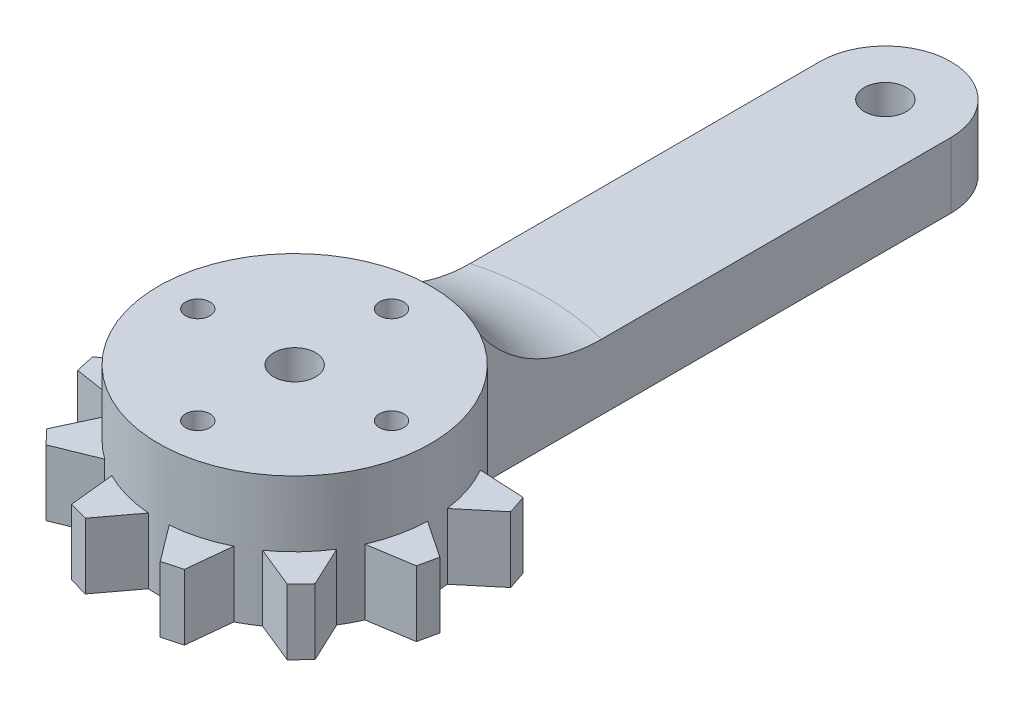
ISO-10303-21;
HEADER;
FILE_DESCRIPTION(('STEP AP214'),'2;1');
FILE_NAME('part.step','',(''),(''),'','','');
FILE_SCHEMA(('AUTOMOTIVE_DESIGN { 1 0 10303 214 1 1 1 1 }'));
ENDSEC;
DATA;
#1=APPLICATION_CONTEXT('core data for automotive mechanical design processes');
#2=APPLICATION_PROTOCOL_DEFINITION('international standard','automotive_design',2000,#1);
#3=PRODUCT_CONTEXT('',#1,'mechanical');
#4=PRODUCT('Part','Part','',(#3));
#5=PRODUCT_RELATED_PRODUCT_CATEGORY('part','',(#4));
#6=PRODUCT_DEFINITION_FORMATION('','',#4);
#7=PRODUCT_DEFINITION_CONTEXT('part definition',#1,'design');
#8=PRODUCT_DEFINITION('design','',#6,#7);
#9=PRODUCT_DEFINITION_SHAPE('','',#8);
#10=(LENGTH_UNIT() NAMED_UNIT(*) SI_UNIT(.MILLI.,.METRE.));
#11=(NAMED_UNIT(*) PLANE_ANGLE_UNIT() SI_UNIT($,.RADIAN.));
#12=(NAMED_UNIT(*) SI_UNIT($,.STERADIAN.) SOLID_ANGLE_UNIT());
#13=UNCERTAINTY_MEASURE_WITH_UNIT(LENGTH_MEASURE(1.E-05),#10,'distance_accuracy_value','');
#14=(GEOMETRIC_REPRESENTATION_CONTEXT(3) GLOBAL_UNCERTAINTY_ASSIGNED_CONTEXT((#13)) GLOBAL_UNIT_ASSIGNED_CONTEXT((#10,
#11,#12)) REPRESENTATION_CONTEXT('',''));
#15=CARTESIAN_POINT('',(0.,0.,0.));
#16=DIRECTION('',(0.,0.,1.));
#17=DIRECTION('',(1.,0.,0.));
#18=AXIS2_PLACEMENT_3D('',#15,#16,#17);
#19=CARTESIAN_POINT('',(0.,5.,0.));
#20=DIRECTION('',(0.,1.,0.));
#21=DIRECTION('',(0.,0.,1.));
#22=AXIS2_PLACEMENT_3D('',#19,#20,#21);
#23=PLANE('',#22);
#24=DIRECTION('',(0.600005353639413,0.,-0.79999598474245));
#25=VECTOR('',#24,1.);
#26=CARTESIAN_POINT('',(-2.85292663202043,5.,13.0938042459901));
#27=LINE('',#26,#25);
#28=CARTESIAN_POINT('',(-2.85292663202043,5.,13.0938042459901));
#29=VERTEX_POINT('',#28);
#30=CARTESIAN_POINT('',(-0.794695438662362,5.,10.3495342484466));
#31=VERTEX_POINT('',#30);
#32=EDGE_CURVE('E663',#29,#31,#27,.T.);
#33=ORIENTED_EDGE('',*,*,#32,.T.);
#34=CARTESIAN_POINT('',(0.,5.,0.));
#35=DIRECTION('',(0.,1.,0.));
#36=DIRECTION('',(0.,0.,1.));
#37=AXIS2_PLACEMENT_3D('',#34,#35,#36);
#38=CIRCLE('',#37,10.38);
#39=CARTESIAN_POINT('',(-4.64921725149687,5.,9.28058074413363));
#40=VERTEX_POINT('',#39);
#41=EDGE_CURVE('E352',#40,#31,#38,.T.);
#42=ORIENTED_EDGE('',*,*,#41,.F.);
#43=DIRECTION('',(0.102276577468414,0.,0.994756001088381));
#44=VECTOR('',#43,1.);
#45=CARTESIAN_POINT('',(-4.29837231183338,5.,12.6929466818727));
#46=LINE('',#45,#44);
#47=CARTESIAN_POINT('',(-4.29837231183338,5.,12.6929466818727));
#48=VERTEX_POINT('',#47);
#49=EDGE_CURVE('E646',#40,#48,#46,.T.);
#50=ORIENTED_EDGE('',*,*,#49,.T.);
#51=DIRECTION('',(0.963630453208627,0.,0.267238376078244));
#52=VECTOR('',#51,1.);
#53=CARTESIAN_POINT('',(-4.29837231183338,5.,12.6929466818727));
#54=LINE('',#53,#52);
#55=EDGE_CURVE('E659',#48,#29,#54,.T.);
#56=ORIENTED_EDGE('',*,*,#55,.T.);
#57=EDGE_LOOP('',(#33,#42,#50,#56));
#58=FACE_BOUND('',#57,.T.);
#59=ADVANCED_FACE('F47',(#58),#23,.T.);
#60=DIRECTION('',(0.926333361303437,0.,-0.376704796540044));
#61=VECTOR('',#60,1.);
#62=CARTESIAN_POINT('',(-9.18924315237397,5.,9.75421500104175));
#63=LINE('',#62,#61);
#64=CARTESIAN_POINT('',(-9.18924315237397,5.,9.75421500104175));
#65=VERTEX_POINT('',#64);
#66=CARTESIAN_POINT('',(-6.01159113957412,5.,8.46198392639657));
#67=VERTEX_POINT('',#66);
#68=EDGE_CURVE('E628',#65,#67,#63,.T.);
#69=ORIENTED_EDGE('',*,*,#68,.T.);
#70=CARTESIAN_POINT('',(-8.76500944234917,5.,5.56048644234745));
#71=VERTEX_POINT('',#70);
#72=EDGE_CURVE('E363',#71,#67,#38,.T.);
#73=ORIENTED_EDGE('',*,*,#72,.F.);
#74=DIRECTION('',(-0.424669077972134,0.,0.905348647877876));
#75=VECTOR('',#74,1.);
#76=CARTESIAN_POINT('',(-10.2217750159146,5.,8.66615344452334));
#77=LINE('',#76,#75);
#78=CARTESIAN_POINT('',(-10.2217750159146,5.,8.66615344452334));
#79=VERTEX_POINT('',#78);
#80=EDGE_CURVE('E611',#71,#79,#77,.T.);
#81=ORIENTED_EDGE('',*,*,#80,.T.);
#82=DIRECTION('',(0.688354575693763,0.,0.725374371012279));
#83=VECTOR('',#82,1.);
#84=CARTESIAN_POINT('',(-10.2217750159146,5.,8.66615344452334));
#85=LINE('',#84,#83);
#86=EDGE_CURVE('E624',#79,#65,#85,.T.);
#87=ORIENTED_EDGE('',*,*,#86,.T.);
#88=EDGE_LOOP('',(#69,#73,#81,#87));
#89=FACE_BOUND('',#88,.T.);
#90=ADVANCED_FACE('F917',(#89),#23,.T.);
#91=DIRECTION('',(0.988039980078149,0.,0.154197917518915));
#92=VECTOR('',#91,1.);
#93=CARTESIAN_POINT('',(-12.9005108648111,5.,3.62818403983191));
#94=LINE('',#93,#92);
#95=CARTESIAN_POINT('',(-12.9005108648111,5.,3.62818403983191));
#96=VERTEX_POINT('',#95);
#97=CARTESIAN_POINT('',(-9.5111832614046,5.,4.1571375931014));
#98=VERTEX_POINT('',#97);
#99=EDGE_CURVE('E593',#96,#98,#94,.T.);
#100=ORIENTED_EDGE('',*,*,#99,.T.);
#101=CARTESIAN_POINT('',(-10.3769417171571,5.,0.251953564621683));
#102=VERTEX_POINT('',#101);
#103=EDGE_CURVE('E369',#102,#98,#38,.T.);
#104=ORIENTED_EDGE('',*,*,#103,.F.);
#105=DIRECTION('',(-0.830301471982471,0.,0.55731451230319));
#106=VECTOR('',#105,1.);
#107=CARTESIAN_POINT('',(-13.2251702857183,5.,2.16374002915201));
#108=LINE('',#107,#106);
#109=CARTESIAN_POINT('',(-13.2251702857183,5.,2.16374002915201));
#110=VERTEX_POINT('',#109);
#111=EDGE_CURVE('E576',#102,#110,#108,.T.);
#112=ORIENTED_EDGE('',*,*,#111,.T.);
#113=DIRECTION('',(0.216439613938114,0.,0.976296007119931));
#114=VECTOR('',#113,1.);
#115=CARTESIAN_POINT('',(-13.2251702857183,5.,2.16374002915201));
#116=LINE('',#115,#114);
#117=EDGE_CURVE('E589',#110,#96,#116,.T.);
#118=ORIENTED_EDGE('',*,*,#117,.T.);
#119=EDGE_LOOP('',(#100,#104,#112,#118));
#120=FACE_BOUND('',#119,.T.);
#121=ADVANCED_FACE('F922',(#120),#23,.T.);
#122=DIRECTION('',(0.767497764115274,0.,0.641051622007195));
#123=VECTOR('',#122,1.);
#124=CARTESIAN_POINT('',(-12.9265489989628,5.,-3.53429356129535));
#125=LINE('',#124,#123);
#126=CARTESIAN_POINT('',(-12.9265489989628,5.,-3.53429356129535));
#127=VERTEX_POINT('',#126);
#128=CARTESIAN_POINT('',(-10.2937594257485,5.,-1.33525910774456));
#129=VERTEX_POINT('',#128);
#130=EDGE_CURVE('E558',#127,#129,#125,.T.);
#131=ORIENTED_EDGE('',*,*,#130,.T.);
#132=CARTESIAN_POINT('',(-9.02454080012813,5.,-5.12855372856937));
#133=VERTEX_POINT('',#132);
#134=EDGE_CURVE('E973',#133,#129,#38,.T.);
#135=ORIENTED_EDGE('',*,*,#134,.F.);
#136=DIRECTION('',(-0.998745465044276,0.,0.0500749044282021));
#137=VECTOR('',#136,1.);
#138=CARTESIAN_POINT('',(-12.4505920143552,5.,-4.95677904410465));
#139=LINE('',#138,#137);
#140=CARTESIAN_POINT('',(-12.4505920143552,5.,-4.95677904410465));
#141=VERTEX_POINT('',#140);
#142=EDGE_CURVE('E541',#133,#141,#139,.T.);
#143=ORIENTED_EDGE('',*,*,#142,.T.);
#144=DIRECTION('',(-0.317304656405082,0.,0.948323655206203));
#145=VECTOR('',#144,1.);
#146=CARTESIAN_POINT('',(-12.4505920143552,5.,-4.95677904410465));
#147=LINE('',#146,#145);
#148=EDGE_CURVE('E554',#141,#127,#147,.T.);
#149=ORIENTED_EDGE('',*,*,#148,.T.);
#150=EDGE_LOOP('',(#131,#135,#143,#149));
#151=FACE_BOUND('',#150,.T.);
#152=ADVANCED_FACE('F982',(#151),#23,.T.);
#153=DIRECTION('',(0.327707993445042,0.,0.94477905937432));
#154=VECTOR('',#153,1.);
#155=CARTESIAN_POINT('',(-9.25991936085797,5.,-9.68714578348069));
#156=LINE('',#155,#154);
#157=CARTESIAN_POINT('',(-9.25991936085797,5.,-9.68714578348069));
#158=VERTEX_POINT('',#157);
#159=CARTESIAN_POINT('',(-8.13576470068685,5.,-6.44621848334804));
#160=VERTEX_POINT('',#159);
#161=EDGE_CURVE('E523',#158,#160,#156,.T.);
#162=ORIENTED_EDGE('',*,*,#161,.T.);
#163=CARTESIAN_POINT('',(-5.09414083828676,5.,-9.0440106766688));
#164=VERTEX_POINT('',#163);
#165=EDGE_CURVE('E984',#164,#160,#38,.T.);
#166=ORIENTED_EDGE('',*,*,#165,.F.);
#167=DIRECTION('',(-0.881882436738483,0.,-0.471469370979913));
#168=VECTOR('',#167,1.);
#169=CARTESIAN_POINT('',(-8.11931041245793,5.,-10.661317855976));
#170=LINE('',#169,#168);
#171=CARTESIAN_POINT('',(-8.11931041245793,5.,-10.661317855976));
#172=VERTEX_POINT('',#171);
#173=EDGE_CURVE('E506',#164,#172,#170,.T.);
#174=ORIENTED_EDGE('',*,*,#173,.T.);
#175=DIRECTION('',(-0.760405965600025,0.,0.649448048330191));
#176=VECTOR('',#175,1.);
#177=CARTESIAN_POINT('',(-8.11931041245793,5.,-10.661317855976));
#178=LINE('',#177,#176);
#179=EDGE_CURVE('E519',#172,#158,#178,.T.);
#180=ORIENTED_EDGE('',*,*,#179,.T.);
#181=EDGE_LOOP('',(#162,#166,#174,#180));
#182=FACE_BOUND('',#181,.T.);
#183=ADVANCED_FACE('F994',(#182),#23,.T.);
#184=CARTESIAN_POINT('',(0.,5.,-45.));
#185=DIRECTION('',(0.,1.,0.));
#186=DIRECTION('',(0.,0.,1.));
#187=AXIS2_PLACEMENT_3D('',#184,#185,#186);
#188=CIRCLE('',#187,1.6);
#189=CARTESIAN_POINT('',(0.,5.,-43.4));
#190=VERTEX_POINT('',#189);
#191=EDGE_CURVE('E692',#190,#190,#188,.T.);
#192=ORIENTED_EDGE('',*,*,#191,.F.);
#193=EDGE_LOOP('',(#192));
#194=FACE_BOUND('',#193,.T.);
#195=DIRECTION('',(0.,0.,-1.));
#196=VECTOR('',#195,1.);
#197=CARTESIAN_POINT('',(-5.,5.,0.));
#198=LINE('',#197,#196);
#199=CARTESIAN_POINT('',(-5.,5.,-18.3720242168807));
#200=VERTEX_POINT('',#199);
#201=CARTESIAN_POINT('',(-5.,5.,-45.));
#202=VERTEX_POINT('',#201);
#203=EDGE_CURVE('E681',#200,#202,#198,.T.);
#204=ORIENTED_EDGE('',*,*,#203,.F.);
#205=CARTESIAN_POINT('',(0.,5.,0.));
#206=DIRECTION('',(0.,1.,0.));
#207=DIRECTION('',(0.,0.,1.));
#208=AXIS2_PLACEMENT_3D('',#205,#206,#207);
#209=CIRCLE('',#208,19.0402540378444);
#210=CARTESIAN_POINT('',(5.,5.,-18.3720242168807));
#211=VERTEX_POINT('',#210);
#212=EDGE_CURVE('E69',#200,#211,#209,.F.);
#213=ORIENTED_EDGE('',*,*,#212,.T.);
#214=DIRECTION('',(0.,0.,-1.));
#215=VECTOR('',#214,1.);
#216=CARTESIAN_POINT('',(5.,5.,0.));
#217=LINE('',#216,#215);
#218=CARTESIAN_POINT('',(5.,5.,-45.));
#219=VERTEX_POINT('',#218);
#220=EDGE_CURVE('E684',#211,#219,#217,.T.);
#221=ORIENTED_EDGE('',*,*,#220,.T.);
#222=CARTESIAN_POINT('',(0.,5.,-45.));
#223=DIRECTION('',(0.,1.,0.));
#224=DIRECTION('',(0.,0.,1.));
#225=AXIS2_PLACEMENT_3D('',#222,#223,#224);
#226=CIRCLE('',#225,5.);
#227=EDGE_CURVE('E688',#219,#202,#226,.T.);
#228=ORIENTED_EDGE('',*,*,#227,.T.);
#229=EDGE_LOOP('',(#204,#213,#221,#228));
#230=FACE_BOUND('',#229,.T.);
#231=ADVANCED_FACE('F998',(#194,#230),#23,.T.);
#232=DIRECTION('',(-0.998745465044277,0.,-0.0500749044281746));
#233=VECTOR('',#232,1.);
#234=CARTESIAN_POINT('',(12.450592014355,5.,-4.95677904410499));
#235=LINE('',#234,#233);
#236=CARTESIAN_POINT('',(12.450592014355,5.,-4.95677904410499));
#237=VERTEX_POINT('',#236);
#238=CARTESIAN_POINT('',(9.02454080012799,5.,-5.12855372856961));
#239=VERTEX_POINT('',#238);
#240=EDGE_CURVE('E393',#237,#239,#235,.T.);
#241=ORIENTED_EDGE('',*,*,#240,.T.);
#242=CARTESIAN_POINT('',(10.2937594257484,5.,-1.33525910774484));
#243=VERTEX_POINT('',#242);
#244=EDGE_CURVE('E988',#243,#239,#38,.T.);
#245=ORIENTED_EDGE('',*,*,#244,.F.);
#246=DIRECTION('',(0.767497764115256,0.,-0.641051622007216));
#247=VECTOR('',#246,1.);
#248=CARTESIAN_POINT('',(12.9265489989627,5.,-3.5342935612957));
#249=LINE('',#248,#247);
#250=CARTESIAN_POINT('',(12.9265489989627,5.,-3.5342935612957));
#251=VERTEX_POINT('',#250);
#252=EDGE_CURVE('E382',#243,#251,#249,.T.);
#253=ORIENTED_EDGE('',*,*,#252,.T.);
#254=DIRECTION('',(-0.317304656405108,0.,-0.948323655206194));
#255=VECTOR('',#254,1.);
#256=CARTESIAN_POINT('',(12.9265489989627,5.,-3.5342935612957));
#257=LINE('',#256,#255);
#258=EDGE_CURVE('E387',#251,#237,#257,.T.);
#259=ORIENTED_EDGE('',*,*,#258,.T.);
#260=EDGE_LOOP('',(#241,#245,#253,#259));
#261=FACE_BOUND('',#260,.T.);
#262=ADVANCED_FACE('F1003',(#261),#23,.T.);
#263=DIRECTION('',(-0.830301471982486,0.,-0.557314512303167));
#264=VECTOR('',#263,1.);
#265=CARTESIAN_POINT('',(13.2251702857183,5.,2.16374002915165));
#266=LINE('',#265,#264);
#267=CARTESIAN_POINT('',(13.2251702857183,5.,2.16374002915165));
#268=VERTEX_POINT('',#267);
#269=CARTESIAN_POINT('',(10.3769417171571,5.,0.251953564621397));
#270=VERTEX_POINT('',#269);
#271=EDGE_CURVE('E435',#268,#270,#266,.T.);
#272=ORIENTED_EDGE('',*,*,#271,.T.);
#273=CARTESIAN_POINT('',(9.51118326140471,5.,4.15713759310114));
#274=VERTEX_POINT('',#273);
#275=EDGE_CURVE('E359',#274,#270,#38,.T.);
#276=ORIENTED_EDGE('',*,*,#275,.F.);
#277=DIRECTION('',(0.988039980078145,0.,-0.154197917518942));
#278=VECTOR('',#277,1.);
#279=CARTESIAN_POINT('',(12.9005108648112,5.,3.62818403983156));
#280=LINE('',#279,#278);
#281=CARTESIAN_POINT('',(12.9005108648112,5.,3.62818403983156));
#282=VERTEX_POINT('',#281);
#283=EDGE_CURVE('E418',#274,#282,#280,.T.);
#284=ORIENTED_EDGE('',*,*,#283,.T.);
#285=DIRECTION('',(0.216439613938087,0.,-0.976296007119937));
#286=VECTOR('',#285,1.);
#287=CARTESIAN_POINT('',(12.9005108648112,5.,3.62818403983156));
#288=LINE('',#287,#286);
#289=EDGE_CURVE('E431',#282,#268,#288,.T.);
#290=ORIENTED_EDGE('',*,*,#289,.T.);
#291=EDGE_LOOP('',(#272,#276,#284,#290));
#292=FACE_BOUND('',#291,.T.);
#293=ADVANCED_FACE('F1044',(#292),#23,.T.);
#294=DIRECTION('',(-0.424669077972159,0.,-0.905348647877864));
#295=VECTOR('',#294,1.);
#296=CARTESIAN_POINT('',(10.2217750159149,5.,8.66615344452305));
#297=LINE('',#296,#295);
#298=CARTESIAN_POINT('',(10.2217750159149,5.,8.66615344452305));
#299=VERTEX_POINT('',#298);
#300=CARTESIAN_POINT('',(8.76500944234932,5.,5.56048644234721));
#301=VERTEX_POINT('',#300);
#302=EDGE_CURVE('E469',#299,#301,#297,.T.);
#303=ORIENTED_EDGE('',*,*,#302,.T.);
#304=CARTESIAN_POINT('',(6.01159113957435,5.,8.4619839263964));
#305=VERTEX_POINT('',#304);
#306=EDGE_CURVE('E350',#305,#301,#38,.T.);
#307=ORIENTED_EDGE('',*,*,#306,.F.);
#308=DIRECTION('',(0.926333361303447,0.,0.376704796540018));
#309=VECTOR('',#308,1.);
#310=CARTESIAN_POINT('',(9.18924315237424,5.,9.7542150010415));
#311=LINE('',#310,#309);
#312=CARTESIAN_POINT('',(9.18924315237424,5.,9.7542150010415));
#313=VERTEX_POINT('',#312);
#314=EDGE_CURVE('E453',#305,#313,#311,.T.);
#315=ORIENTED_EDGE('',*,*,#314,.T.);
#316=DIRECTION('',(0.688354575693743,0.,-0.725374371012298));
#317=VECTOR('',#316,1.);
#318=CARTESIAN_POINT('',(9.18924315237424,5.,9.7542150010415));
#319=LINE('',#318,#317);
#320=EDGE_CURVE('E465',#313,#299,#319,.T.);
#321=ORIENTED_EDGE('',*,*,#320,.T.);
#322=EDGE_LOOP('',(#303,#307,#315,#321));
#323=FACE_BOUND('',#322,.T.);
#324=ADVANCED_FACE('F758',(#323),#23,.T.);
#325=CARTESIAN_POINT('',(-5.,5.,0.));
#326=DIRECTION('',(-1.,0.,0.));
#327=DIRECTION('',(0.,0.,1.));
#328=AXIS2_PLACEMENT_3D('',#325,#326,#327);
#329=PLANE('',#328);
#330=DIRECTION('',(0.,0.,-1.));
#331=VECTOR('',#330,1.);
#332=CARTESIAN_POINT('',(-5.,0.,0.));
#333=LINE('',#332,#331);
#334=CARTESIAN_POINT('',(-5.,0.,-9.09639489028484));
#335=VERTEX_POINT('',#334);
#336=CARTESIAN_POINT('',(-5.,0.,-45.));
#337=VERTEX_POINT('',#336);
#338=EDGE_CURVE('E680',#335,#337,#333,.T.);
#339=ORIENTED_EDGE('',*,*,#338,.F.);
#340=DIRECTION('',(0.,-1.,0.));
#341=VECTOR('',#340,1.);
#342=CARTESIAN_POINT('',(-5.,5.,-9.09639489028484));
#343=LINE('',#342,#341);
#344=CARTESIAN_POINT('',(-5.,10.,-9.09639489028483));
#345=VERTEX_POINT('',#344);
#346=EDGE_CURVE('E729',#345,#335,#343,.T.);
#347=ORIENTED_EDGE('',*,*,#346,.F.);
#348=CARTESIAN_POINT('',(-5.,10.,-9.09639489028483));
#349=CARTESIAN_POINT('',(-5.,9.75482474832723,-9.25794247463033));
#350=CARTESIAN_POINT('',(-5.,9.51650365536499,-9.42977447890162));
#351=CARTESIAN_POINT('',(-5.,9.05473396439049,-9.79222079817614));
#352=CARTESIAN_POINT('',(-5.,8.83127974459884,-9.98282794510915));
#353=CARTESIAN_POINT('',(-5.,8.40034423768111,-10.3810485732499));
#354=CARTESIAN_POINT('',(-5.,8.19285380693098,-10.5886521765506));
#355=CARTESIAN_POINT('',(-5.,7.79469117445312,-11.0194463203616));
#356=CARTESIAN_POINT('',(-5.,7.60402126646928,-11.2426389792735));
#357=CARTESIAN_POINT('',(-5.,7.23090583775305,-11.7153019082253));
#358=CARTESIAN_POINT('',(-5.,7.04942925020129,-11.9655377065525));
#359=CARTESIAN_POINT('',(-5.,6.70741051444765,-12.4799306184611));
#360=CARTESIAN_POINT('',(-5.,6.54686874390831,-12.744087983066));
#361=CARTESIAN_POINT('',(-5.,6.24781035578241,-13.2846490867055));
#362=CARTESIAN_POINT('',(-5.,6.10929725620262,-13.5610547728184));
#363=CARTESIAN_POINT('',(-5.,5.85544543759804,-14.1241646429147));
#364=CARTESIAN_POINT('',(-5.,5.74009629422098,-14.4108641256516));
#365=CARTESIAN_POINT('',(-5.,5.53251441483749,-14.9955172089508));
#366=CARTESIAN_POINT('',(-5.,5.44050580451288,-15.2935504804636));
#367=CARTESIAN_POINT('',(-5.,5.28190579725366,-15.8962988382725));
#368=CARTESIAN_POINT('',(-5.,5.21531341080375,-16.2010136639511));
#369=CARTESIAN_POINT('',(-5.,5.10820847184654,-16.8155615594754));
#370=CARTESIAN_POINT('',(-5.,5.06774238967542,-17.1254027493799));
#371=CARTESIAN_POINT('',(-5.,5.01361723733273,-17.7474927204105));
#372=CARTESIAN_POINT('',(-5.,4.99996503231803,-18.0597420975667));
#373=CARTESIAN_POINT('',(-5.,5.,-18.3720242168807));
#374=B_SPLINE_CURVE_WITH_KNOTS('',3,(#348,#349,#350,#351,#352,#353,#354,#355,#356,#357,#358,
#359,#360,#361,#362,#363,#364,#365,#366,#367,#368,#369,#370,#371,#372,#373),.UNSPECIFIED.,.F.,
.F.,(4,2,2,2,2,2,2,2,2,2,2,2,4),(0.,0.880485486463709,1.76063611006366,2.64027879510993,
3.52004124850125,4.44635213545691,5.37267973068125,6.29915511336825,7.22521262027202,
8.15985190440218,9.09445479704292,10.0307155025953,10.9672158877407),.UNSPECIFIED.);
#375=EDGE_CURVE('E62',#345,#200,#374,.T.);
#376=ORIENTED_EDGE('',*,*,#375,.T.);
#377=ORIENTED_EDGE('',*,*,#203,.T.);
#378=DIRECTION('',(0.,-1.,0.));
#379=VECTOR('',#378,1.);
#380=CARTESIAN_POINT('',(-5.,5.,-45.));
#381=LINE('',#380,#379);
#382=EDGE_CURVE('E696',#202,#337,#381,.T.);
#383=ORIENTED_EDGE('',*,*,#382,.T.);
#384=EDGE_LOOP('',(#339,#347,#376,#377,#383));
#385=FACE_BOUND('',#384,.T.);
#386=ADVANCED_FACE('F754',(#385),#329,.T.);
#387=CARTESIAN_POINT('',(0.,5.,0.));
#388=DIRECTION('',(0.,-1.,0.));
#389=DIRECTION('',(0.,0.,-1.));
#390=AXIS2_PLACEMENT_3D('',#387,#388,#389);
#391=CYLINDRICAL_SURFACE('',#390,10.38);
#392=CARTESIAN_POINT('',(0.,10.,0.));
#393=DIRECTION('',(0.,1.,0.));
#394=DIRECTION('',(0.,0.,1.));
#395=AXIS2_PLACEMENT_3D('',#392,#393,#394);
#396=CIRCLE('',#395,10.38);
#397=CARTESIAN_POINT('',(5.,10.,-9.09639489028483));
#398=VERTEX_POINT('',#397);
#399=EDGE_CURVE('E349',#345,#398,#396,.T.);
#400=ORIENTED_EDGE('',*,*,#399,.F.);
#401=ORIENTED_EDGE('',*,*,#346,.T.);
#402=CARTESIAN_POINT('',(0.,0.,0.));
#403=DIRECTION('',(0.,1.,0.));
#404=DIRECTION('',(0.,0.,1.));
#405=AXIS2_PLACEMENT_3D('',#402,#403,#404);
#406=CIRCLE('',#405,10.38);
#407=CARTESIAN_POINT('',(-5.09414083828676,0.,-9.0440106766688));
#408=VERTEX_POINT('',#407);
#409=EDGE_CURVE('E701',#335,#408,#406,.T.);
#410=ORIENTED_EDGE('',*,*,#409,.T.);
#411=DIRECTION('',(0.,1.,0.));
#412=VECTOR('',#411,1.);
#413=CARTESIAN_POINT('',(-5.09414083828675,-5.92627820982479,-9.04401067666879));
#414=LINE('',#413,#412);
#415=EDGE_CURVE('E511',#408,#164,#414,.T.);
#416=ORIENTED_EDGE('',*,*,#415,.T.);
#417=ORIENTED_EDGE('',*,*,#165,.T.);
#418=DIRECTION('',(0.,1.,0.));
#419=VECTOR('',#418,1.);
#420=CARTESIAN_POINT('',(-8.13576470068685,-5.92627820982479,-6.44621848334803));
#421=LINE('',#420,#419);
#422=CARTESIAN_POINT('',(-8.13576470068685,0.,-6.44621848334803));
#423=VERTEX_POINT('',#422);
#424=EDGE_CURVE('E531',#423,#160,#421,.T.);
#425=ORIENTED_EDGE('',*,*,#424,.F.);
#426=CARTESIAN_POINT('',(-9.02454080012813,0.,-5.12855372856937));
#427=VERTEX_POINT('',#426);
#428=EDGE_CURVE('E705',#423,#427,#406,.T.);
#429=ORIENTED_EDGE('',*,*,#428,.T.);
#430=DIRECTION('',(0.,1.,0.));
#431=VECTOR('',#430,1.);
#432=CARTESIAN_POINT('',(-9.02454080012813,-5.44194377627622,-5.12855372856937));
#433=LINE('',#432,#431);
#434=EDGE_CURVE('E546',#427,#133,#433,.T.);
#435=ORIENTED_EDGE('',*,*,#434,.T.);
#436=ORIENTED_EDGE('',*,*,#134,.T.);
#437=DIRECTION('',(0.,1.,0.));
#438=VECTOR('',#437,1.);
#439=CARTESIAN_POINT('',(-10.2937594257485,-5.44194377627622,-1.33525910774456));
#440=LINE('',#439,#438);
#441=CARTESIAN_POINT('',(-10.2937594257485,0.,-1.33525910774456));
#442=VERTEX_POINT('',#441);
#443=EDGE_CURVE('E566',#442,#129,#440,.T.);
#444=ORIENTED_EDGE('',*,*,#443,.F.);
#445=CARTESIAN_POINT('',(-10.3769417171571,0.,0.251953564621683));
#446=VERTEX_POINT('',#445);
#447=EDGE_CURVE('E941',#442,#446,#406,.T.);
#448=ORIENTED_EDGE('',*,*,#447,.T.);
#449=DIRECTION('',(0.,1.,0.));
#450=VECTOR('',#449,1.);
#451=CARTESIAN_POINT('',(-10.3769417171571,-5.38926357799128,0.251953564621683));
#452=LINE('',#451,#450);
#453=EDGE_CURVE('E581',#446,#102,#452,.T.);
#454=ORIENTED_EDGE('',*,*,#453,.T.);
#455=ORIENTED_EDGE('',*,*,#103,.T.);
#456=DIRECTION('',(0.,1.,0.));
#457=VECTOR('',#456,1.);
#458=CARTESIAN_POINT('',(-9.5111832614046,-5.38926357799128,4.15713759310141));
#459=LINE('',#458,#457);
#460=CARTESIAN_POINT('',(-9.5111832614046,0.,4.1571375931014));
#461=VERTEX_POINT('',#460);
#462=EDGE_CURVE('E601',#461,#98,#459,.T.);
#463=ORIENTED_EDGE('',*,*,#462,.F.);
#464=CARTESIAN_POINT('',(-8.76500944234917,0.,5.56048644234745));
#465=VERTEX_POINT('',#464);
#466=EDGE_CURVE('E936',#461,#465,#406,.T.);
#467=ORIENTED_EDGE('',*,*,#466,.T.);
#468=DIRECTION('',(0.,1.,0.));
#469=VECTOR('',#468,1.);
#470=CARTESIAN_POINT('',(-8.76500944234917,-5.94247486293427,5.56048644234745));
#471=LINE('',#470,#469);
#472=EDGE_CURVE('E616',#465,#71,#471,.T.);
#473=ORIENTED_EDGE('',*,*,#472,.T.);
#474=ORIENTED_EDGE('',*,*,#72,.T.);
#475=DIRECTION('',(0.,1.,0.));
#476=VECTOR('',#475,1.);
#477=CARTESIAN_POINT('',(-6.01159113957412,-5.94247486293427,8.46198392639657));
#478=LINE('',#477,#476);
#479=CARTESIAN_POINT('',(-6.01159113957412,0.,8.46198392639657));
#480=VERTEX_POINT('',#479);
#481=EDGE_CURVE('E636',#480,#67,#478,.T.);
#482=ORIENTED_EDGE('',*,*,#481,.F.);
#483=CARTESIAN_POINT('',(-4.64921725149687,0.,9.28058074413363));
#484=VERTEX_POINT('',#483);
#485=EDGE_CURVE('E932',#480,#484,#406,.T.);
#486=ORIENTED_EDGE('',*,*,#485,.T.);
#487=DIRECTION('',(0.,1.,0.));
#488=VECTOR('',#487,1.);
#489=CARTESIAN_POINT('',(-4.64921725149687,-5.42199334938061,9.28058074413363));
#490=LINE('',#489,#488);
#491=EDGE_CURVE('E651',#484,#40,#490,.T.);
#492=ORIENTED_EDGE('',*,*,#491,.T.);
#493=ORIENTED_EDGE('',*,*,#41,.T.);
#494=DIRECTION('',(0.,1.,0.));
#495=VECTOR('',#494,1.);
#496=CARTESIAN_POINT('',(-0.794695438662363,-5.42199334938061,10.3495342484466));
#497=LINE('',#496,#495);
#498=CARTESIAN_POINT('',(-0.794695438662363,0.,10.3495342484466));
#499=VERTEX_POINT('',#498);
#500=EDGE_CURVE('E670',#499,#31,#497,.T.);
#501=ORIENTED_EDGE('',*,*,#500,.F.);
#502=CARTESIAN_POINT('',(0.794695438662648,0.,10.3495342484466));
#503=VERTEX_POINT('',#502);
#504=EDGE_CURVE('E338',#499,#503,#406,.T.);
#505=ORIENTED_EDGE('',*,*,#504,.T.);
#506=DIRECTION('',(0.,1.,0.));
#507=VECTOR('',#506,1.);
#508=CARTESIAN_POINT('',(0.794695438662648,-5.42199334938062,10.3495342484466));
#509=LINE('',#508,#507);
#510=CARTESIAN_POINT('',(0.794695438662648,5.,10.3495342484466));
#511=VERTEX_POINT('',#510);
#512=EDGE_CURVE('E320',#503,#511,#509,.T.);
#513=ORIENTED_EDGE('',*,*,#512,.T.);
#514=CARTESIAN_POINT('',(4.64921725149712,5.,9.2805807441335));
#515=VERTEX_POINT('',#514);
#516=EDGE_CURVE('E336',#511,#515,#38,.T.);
#517=ORIENTED_EDGE('',*,*,#516,.T.);
#518=DIRECTION('',(0.,1.,0.));
#519=VECTOR('',#518,1.);
#520=CARTESIAN_POINT('',(4.64921725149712,-5.42199334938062,9.2805807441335));
#521=LINE('',#520,#519);
#522=CARTESIAN_POINT('',(4.64921725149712,0.,9.2805807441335));
#523=VERTEX_POINT('',#522);
#524=EDGE_CURVE('E342',#523,#515,#521,.T.);
#525=ORIENTED_EDGE('',*,*,#524,.F.);
#526=CARTESIAN_POINT('',(6.01159113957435,0.,8.4619839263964));
#527=VERTEX_POINT('',#526);
#528=EDGE_CURVE('E933',#523,#527,#406,.T.);
#529=ORIENTED_EDGE('',*,*,#528,.T.);
#530=DIRECTION('',(0.,1.,0.));
#531=VECTOR('',#530,1.);
#532=CARTESIAN_POINT('',(6.01159113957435,-5.94247486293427,8.4619839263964));
#533=LINE('',#532,#531);
#534=EDGE_CURVE('E458',#527,#305,#533,.T.);
#535=ORIENTED_EDGE('',*,*,#534,.T.);
#536=ORIENTED_EDGE('',*,*,#306,.T.);
#537=DIRECTION('',(0.,1.,0.));
#538=VECTOR('',#537,1.);
#539=CARTESIAN_POINT('',(8.76500944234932,-5.94247486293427,5.56048644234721));
#540=LINE('',#539,#538);
#541=CARTESIAN_POINT('',(8.76500944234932,0.,5.56048644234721));
#542=VERTEX_POINT('',#541);
#543=EDGE_CURVE('E477',#542,#301,#540,.T.);
#544=ORIENTED_EDGE('',*,*,#543,.F.);
#545=CARTESIAN_POINT('',(9.51118326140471,0.,4.15713759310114));
#546=VERTEX_POINT('',#545);
#547=EDGE_CURVE('E937',#542,#546,#406,.T.);
#548=ORIENTED_EDGE('',*,*,#547,.T.);
#549=DIRECTION('',(0.,1.,0.));
#550=VECTOR('',#549,1.);
#551=CARTESIAN_POINT('',(9.51118326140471,-5.38926357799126,4.15713759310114));
#552=LINE('',#551,#550);
#553=EDGE_CURVE('E423',#546,#274,#552,.T.);
#554=ORIENTED_EDGE('',*,*,#553,.T.);
#555=ORIENTED_EDGE('',*,*,#275,.T.);
#556=DIRECTION('',(0.,1.,0.));
#557=VECTOR('',#556,1.);
#558=CARTESIAN_POINT('',(10.3769417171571,-5.38926357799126,0.251953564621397));
#559=LINE('',#558,#557);
#560=CARTESIAN_POINT('',(10.3769417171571,0.,0.251953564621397));
#561=VERTEX_POINT('',#560);
#562=EDGE_CURVE('E443',#561,#270,#559,.T.);
#563=ORIENTED_EDGE('',*,*,#562,.F.);
#564=CARTESIAN_POINT('',(10.2937594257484,0.,-1.33525910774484));
#565=VERTEX_POINT('',#564);
#566=EDGE_CURVE('E939',#561,#565,#406,.T.);
#567=ORIENTED_EDGE('',*,*,#566,.T.);
#568=DIRECTION('',(0.,1.,0.));
#569=VECTOR('',#568,1.);
#570=CARTESIAN_POINT('',(10.2937594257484,-5.44194377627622,-1.33525910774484));
#571=LINE('',#570,#569);
#572=EDGE_CURVE('E402',#565,#243,#571,.T.);
#573=ORIENTED_EDGE('',*,*,#572,.T.);
#574=ORIENTED_EDGE('',*,*,#244,.T.);
#575=DIRECTION('',(0.,1.,0.));
#576=VECTOR('',#575,1.);
#577=CARTESIAN_POINT('',(9.02454080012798,-5.44194377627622,-5.12855372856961));
#578=LINE('',#577,#576);
#579=CARTESIAN_POINT('',(9.02454080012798,0.,-5.12855372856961));
#580=VERTEX_POINT('',#579);
#581=EDGE_CURVE('E407',#580,#239,#578,.T.);
#582=ORIENTED_EDGE('',*,*,#581,.F.);
#583=CARTESIAN_POINT('',(5.,0.,-9.09639489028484));
#584=VERTEX_POINT('',#583);
#585=EDGE_CURVE('E700',#580,#584,#406,.T.);
#586=ORIENTED_EDGE('',*,*,#585,.T.);
#587=DIRECTION('',(0.,-1.,0.));
#588=VECTOR('',#587,1.);
#589=CARTESIAN_POINT('',(5.,5.,-9.09639489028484));
#590=LINE('',#589,#588);
#591=EDGE_CURVE('E725',#398,#584,#590,.T.);
#592=ORIENTED_EDGE('',*,*,#591,.F.);
#593=EDGE_LOOP('',(#400,#401,#410,#416,#417,#425,#429,#435,#436,#444,#448,#454,#455,#463,#467,
#473,#474,#482,#486,#492,#493,#501,#505,#513,#517,#525,#529,#535,#536,#544,#548,#554,#555,#563,
#567,#573,#574,#582,#586,#592));
#594=FACE_BOUND('',#593,.T.);
#595=ADVANCED_FACE('F334',(#594),#391,.T.);
#596=CARTESIAN_POINT('',(5.,5.,0.));
#597=DIRECTION('',(-1.,0.,0.));
#598=DIRECTION('',(0.,0.,1.));
#599=AXIS2_PLACEMENT_3D('',#596,#597,#598);
#600=PLANE('',#599);
#601=DIRECTION('',(0.,0.,-1.));
#602=VECTOR('',#601,1.);
#603=CARTESIAN_POINT('',(5.,0.,0.));
#604=LINE('',#603,#602);
#605=CARTESIAN_POINT('',(5.,0.,-45.));
#606=VERTEX_POINT('',#605);
#607=EDGE_CURVE('E704',#584,#606,#604,.T.);
#608=ORIENTED_EDGE('',*,*,#607,.T.);
#609=DIRECTION('',(0.,-1.,0.));
#610=VECTOR('',#609,1.);
#611=CARTESIAN_POINT('',(5.,5.,-45.));
#612=LINE('',#611,#610);
#613=EDGE_CURVE('E721',#219,#606,#612,.T.);
#614=ORIENTED_EDGE('',*,*,#613,.F.);
#615=ORIENTED_EDGE('',*,*,#220,.F.);
#616=CARTESIAN_POINT('',(5.,5.,-18.3720242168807));
#617=CARTESIAN_POINT('',(5.,4.99996573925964,-18.0613214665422));
#618=CARTESIAN_POINT('',(5.,5.01347987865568,-17.750650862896));
#619=CARTESIAN_POINT('',(5.,5.06706087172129,-17.1316840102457));
#620=CARTESIAN_POINT('',(5.,5.10712085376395,-16.8233871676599));
#621=CARTESIAN_POINT('',(5.,5.2131593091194,-16.2118377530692));
#622=CARTESIAN_POINT('',(5.,5.27909337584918,-15.9085774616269));
#623=CARTESIAN_POINT('',(5.,5.43613587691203,-15.3086389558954));
#624=CARTESIAN_POINT('',(5.,5.52724545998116,-15.0119610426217));
#625=CARTESIAN_POINT('',(5.,5.73368324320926,-14.4274180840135));
#626=CARTESIAN_POINT('',(5.,5.84899280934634,-14.1395464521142));
#627=CARTESIAN_POINT('',(5.,6.10294381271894,-13.5741321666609));
#628=CARTESIAN_POINT('',(5.,6.24159590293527,-13.296594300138));
#629=CARTESIAN_POINT('',(5.,6.54110247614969,-12.7538264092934));
#630=CARTESIAN_POINT('',(5.,6.70195373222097,-12.4885946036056));
#631=CARTESIAN_POINT('',(5.,7.04474892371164,-11.9721331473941));
#632=CARTESIAN_POINT('',(5.,7.22669246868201,-11.7209032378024));
#633=CARTESIAN_POINT('',(5.,7.60053561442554,-11.2468093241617));
#634=CARTESIAN_POINT('',(5.,7.79142722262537,-11.0231497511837));
#635=CARTESIAN_POINT('',(5.,8.19009535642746,-10.5914673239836));
#636=CARTESIAN_POINT('',(5.,8.39786955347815,-10.3834423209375));
#637=CARTESIAN_POINT('',(5.,8.82942447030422,-9.98443642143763));
#638=CARTESIAN_POINT('',(5.,9.05321395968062,-9.79346499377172));
#639=CARTESIAN_POINT('',(5.,9.51570611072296,-9.43034963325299));
#640=CARTESIAN_POINT('',(5.,9.75441444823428,-9.25821293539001));
#641=CARTESIAN_POINT('',(5.,10.,-9.09639489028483));
#642=B_SPLINE_CURVE_WITH_KNOTS('',3,(#616,#617,#618,#619,#620,#621,#622,#623,#624,#625,#626,
#627,#628,#629,#630,#631,#632,#633,#634,#635,#636,#637,#638,#639,#640,#641),.UNSPECIFIED.,.F.,
.F.,(4,2,2,2,2,2,2,2,2,2,2,2,4),(0.,0.931767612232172,1.8632941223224,2.79322883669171,
3.72320599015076,4.65246967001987,5.58215859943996,6.51171252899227,7.44124925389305,
8.32250473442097,9.20363887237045,10.0852592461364,10.9672170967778),.UNSPECIFIED.);
#643=EDGE_CURVE('E11',#211,#398,#642,.T.);
#644=ORIENTED_EDGE('',*,*,#643,.T.);
#645=ORIENTED_EDGE('',*,*,#591,.T.);
#646=EDGE_LOOP('',(#608,#614,#615,#644,#645));
#647=FACE_BOUND('',#646,.T.);
#648=ADVANCED_FACE('F760',(#647),#600,.F.);
#649=CARTESIAN_POINT('',(0.,5.,-45.));
#650=DIRECTION('',(0.,-1.,0.));
#651=DIRECTION('',(0.,0.,-1.));
#652=AXIS2_PLACEMENT_3D('',#649,#650,#651);
#653=CYLINDRICAL_SURFACE('',#652,1.6);
#654=ORIENTED_EDGE('',*,*,#191,.T.);
#655=EDGE_LOOP('',(#654));
#656=FACE_BOUND('',#655,.T.);
#657=CARTESIAN_POINT('',(0.,0.,-45.));
#658=DIRECTION('',(0.,1.,0.));
#659=DIRECTION('',(0.,0.,1.));
#660=AXIS2_PLACEMENT_3D('',#657,#658,#659);
#661=CIRCLE('',#660,1.6);
#662=CARTESIAN_POINT('',(0.,0.,-43.4));
#663=VERTEX_POINT('',#662);
#664=EDGE_CURVE('E712',#663,#663,#661,.T.);
#665=ORIENTED_EDGE('',*,*,#664,.F.);
#666=EDGE_LOOP('',(#665));
#667=FACE_BOUND('',#666,.T.);
#668=ADVANCED_FACE('F764',(#656,#667),#653,.F.);
#669=CARTESIAN_POINT('',(0.,5.,-45.));
#670=DIRECTION('',(0.,-1.,0.));
#671=DIRECTION('',(0.,0.,-1.));
#672=AXIS2_PLACEMENT_3D('',#669,#670,#671);
#673=CYLINDRICAL_SURFACE('',#672,5.);
#674=CARTESIAN_POINT('',(0.,0.,-45.));
#675=DIRECTION('',(0.,1.,0.));
#676=DIRECTION('',(0.,0.,1.));
#677=AXIS2_PLACEMENT_3D('',#674,#675,#676);
#678=CIRCLE('',#677,5.);
#679=EDGE_CURVE('E708',#606,#337,#678,.T.);
#680=ORIENTED_EDGE('',*,*,#679,.T.);
#681=ORIENTED_EDGE('',*,*,#382,.F.);
#682=ORIENTED_EDGE('',*,*,#227,.F.);
#683=ORIENTED_EDGE('',*,*,#613,.T.);
#684=EDGE_LOOP('',(#680,#681,#682,#683));
#685=FACE_BOUND('',#684,.T.);
#686=ADVANCED_FACE('F766',(#685),#673,.T.);
#687=CARTESIAN_POINT('',(0.,5.,0.));
#688=DIRECTION('',(0.,-1.,0.));
#689=DIRECTION('',(0.,0.,-1.));
#690=AXIS2_PLACEMENT_3D('',#687,#688,#689);
#691=CYLINDRICAL_SURFACE('',#690,1.6);
#692=CARTESIAN_POINT('',(0.,0.,0.));
#693=DIRECTION('',(0.,1.,0.));
#694=DIRECTION('',(0.,0.,1.));
#695=AXIS2_PLACEMENT_3D('',#692,#693,#694);
#696=CIRCLE('',#695,1.6);
#697=CARTESIAN_POINT('',(0.,0.,1.6));
#698=VERTEX_POINT('',#697);
#699=EDGE_CURVE('E685',#698,#698,#696,.T.);
#700=ORIENTED_EDGE('',*,*,#699,.F.);
#701=EDGE_LOOP('',(#700));
#702=FACE_BOUND('',#701,.T.);
#703=CARTESIAN_POINT('',(0.,10.,0.));
#704=DIRECTION('',(0.,1.,0.));
#705=DIRECTION('',(0.,0.,1.));
#706=AXIS2_PLACEMENT_3D('',#703,#704,#705);
#707=CIRCLE('',#706,1.6);
#708=CARTESIAN_POINT('',(0.,10.,1.6));
#709=VERTEX_POINT('',#708);
#710=EDGE_CURVE('E364',#709,#709,#707,.T.);
#711=ORIENTED_EDGE('',*,*,#710,.T.);
#712=EDGE_LOOP('',(#711));
#713=FACE_BOUND('',#712,.T.);
#714=ADVANCED_FACE('F769',(#702,#713),#691,.F.);
#715=DIRECTION('',(0.102276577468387,0.,-0.994756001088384));
#716=VECTOR('',#715,1.);
#717=CARTESIAN_POINT('',(4.29837231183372,5.,12.6929466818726));
#718=LINE('',#717,#716);
#719=CARTESIAN_POINT('',(4.29837231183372,5.,12.6929466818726));
#720=VERTEX_POINT('',#719);
#721=EDGE_CURVE('E347',#720,#515,#718,.T.);
#722=ORIENTED_EDGE('',*,*,#721,.T.);
#723=ORIENTED_EDGE('',*,*,#516,.F.);
#724=DIRECTION('',(0.600005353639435,0.,0.799995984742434));
#725=VECTOR('',#724,1.);
#726=CARTESIAN_POINT('',(2.85292663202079,5.,13.09380424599));
#727=LINE('',#726,#725);
#728=CARTESIAN_POINT('',(2.85292663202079,5.,13.09380424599));
#729=VERTEX_POINT('',#728);
#730=EDGE_CURVE('E316',#511,#729,#727,.T.);
#731=ORIENTED_EDGE('',*,*,#730,.T.);
#732=DIRECTION('',(0.963630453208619,0.,-0.267238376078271));
#733=VECTOR('',#732,1.);
#734=CARTESIAN_POINT('',(2.85292663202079,5.,13.09380424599));
#735=LINE('',#734,#733);
#736=EDGE_CURVE('E328',#729,#720,#735,.T.);
#737=ORIENTED_EDGE('',*,*,#736,.T.);
#738=EDGE_LOOP('',(#722,#723,#731,#737));
#739=FACE_BOUND('',#738,.T.);
#740=ADVANCED_FACE('F345',(#739),#23,.T.);
#741=CARTESIAN_POINT('',(0.,0.,0.));
#742=DIRECTION('',(0.,1.,0.));
#743=DIRECTION('',(0.,0.,1.));
#744=AXIS2_PLACEMENT_3D('',#741,#742,#743);
#745=PLANE('',#744);
#746=ORIENTED_EDGE('',*,*,#338,.T.);
#747=ORIENTED_EDGE('',*,*,#679,.F.);
#748=ORIENTED_EDGE('',*,*,#607,.F.);
#749=ORIENTED_EDGE('',*,*,#585,.F.);
#750=DIRECTION('',(0.998745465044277,0.,0.0500749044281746));
#751=VECTOR('',#750,1.);
#752=CARTESIAN_POINT('',(12.450592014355,0.,-4.95677904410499));
#753=LINE('',#752,#751);
#754=CARTESIAN_POINT('',(12.450592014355,0.,-4.95677904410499));
#755=VERTEX_POINT('',#754);
#756=EDGE_CURVE('E406',#580,#755,#753,.T.);
#757=ORIENTED_EDGE('',*,*,#756,.T.);
#758=DIRECTION('',(0.317304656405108,0.,0.948323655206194));
#759=VECTOR('',#758,1.);
#760=CARTESIAN_POINT('',(12.9265489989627,0.,-3.5342935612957));
#761=LINE('',#760,#759);
#762=CARTESIAN_POINT('',(12.9265489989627,0.,-3.5342935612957));
#763=VERTEX_POINT('',#762);
#764=EDGE_CURVE('E415',#755,#763,#761,.T.);
#765=ORIENTED_EDGE('',*,*,#764,.T.);
#766=DIRECTION('',(-0.767497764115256,0.,0.641051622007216));
#767=VECTOR('',#766,1.);
#768=CARTESIAN_POINT('',(12.9265489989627,0.,-3.5342935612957));
#769=LINE('',#768,#767);
#770=EDGE_CURVE('E396',#763,#565,#769,.T.);
#771=ORIENTED_EDGE('',*,*,#770,.T.);
#772=ORIENTED_EDGE('',*,*,#566,.F.);
#773=DIRECTION('',(0.830301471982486,0.,0.557314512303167));
#774=VECTOR('',#773,1.);
#775=CARTESIAN_POINT('',(13.2251702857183,0.,2.16374002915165));
#776=LINE('',#775,#774);
#777=CARTESIAN_POINT('',(13.2251702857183,0.,2.16374002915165));
#778=VERTEX_POINT('',#777);
#779=EDGE_CURVE('E419',#561,#778,#776,.T.);
#780=ORIENTED_EDGE('',*,*,#779,.T.);
#781=DIRECTION('',(-0.216439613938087,0.,0.976296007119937));
#782=VECTOR('',#781,1.);
#783=CARTESIAN_POINT('',(12.9005108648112,0.,3.62818403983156));
#784=LINE('',#783,#782);
#785=CARTESIAN_POINT('',(12.9005108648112,0.,3.62818403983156));
#786=VERTEX_POINT('',#785);
#787=EDGE_CURVE('E427',#778,#786,#784,.T.);
#788=ORIENTED_EDGE('',*,*,#787,.T.);
#789=DIRECTION('',(-0.988039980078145,0.,0.154197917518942));
#790=VECTOR('',#789,1.);
#791=CARTESIAN_POINT('',(12.9005108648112,0.,3.62818403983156));
#792=LINE('',#791,#790);
#793=EDGE_CURVE('E422',#786,#546,#792,.T.);
#794=ORIENTED_EDGE('',*,*,#793,.T.);
#795=ORIENTED_EDGE('',*,*,#547,.F.);
#796=DIRECTION('',(0.424669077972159,0.,0.905348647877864));
#797=VECTOR('',#796,1.);
#798=CARTESIAN_POINT('',(10.2217750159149,0.,8.66615344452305));
#799=LINE('',#798,#797);
#800=CARTESIAN_POINT('',(10.2217750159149,0.,8.66615344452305));
#801=VERTEX_POINT('',#800);
#802=EDGE_CURVE('E454',#542,#801,#799,.T.);
#803=ORIENTED_EDGE('',*,*,#802,.T.);
#804=DIRECTION('',(-0.688354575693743,0.,0.725374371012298));
#805=VECTOR('',#804,1.);
#806=CARTESIAN_POINT('',(9.18924315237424,0.,9.7542150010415));
#807=LINE('',#806,#805);
#808=CARTESIAN_POINT('',(9.18924315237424,0.,9.7542150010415));
#809=VERTEX_POINT('',#808);
#810=EDGE_CURVE('E329',#801,#809,#807,.T.);
#811=ORIENTED_EDGE('',*,*,#810,.T.);
#812=DIRECTION('',(-0.926333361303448,0.,-0.376704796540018));
#813=VECTOR('',#812,1.);
#814=CARTESIAN_POINT('',(9.18924315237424,0.,9.7542150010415));
#815=LINE('',#814,#813);
#816=EDGE_CURVE('E457',#809,#527,#815,.T.);
#817=ORIENTED_EDGE('',*,*,#816,.T.);
#818=ORIENTED_EDGE('',*,*,#528,.F.);
#819=DIRECTION('',(-0.102276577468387,0.,0.994756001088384));
#820=VECTOR('',#819,1.);
#821=CARTESIAN_POINT('',(4.29837231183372,0.,12.6929466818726));
#822=LINE('',#821,#820);
#823=CARTESIAN_POINT('',(4.29837231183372,0.,12.6929466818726));
#824=VERTEX_POINT('',#823);
#825=EDGE_CURVE('E341',#523,#824,#822,.T.);
#826=ORIENTED_EDGE('',*,*,#825,.T.);
#827=DIRECTION('',(-0.963630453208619,0.,0.267238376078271));
#828=VECTOR('',#827,1.);
#829=CARTESIAN_POINT('',(2.85292663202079,0.,13.09380424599));
#830=LINE('',#829,#828);
#831=CARTESIAN_POINT('',(2.85292663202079,0.,13.09380424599));
#832=VERTEX_POINT('',#831);
#833=EDGE_CURVE('E491',#824,#832,#830,.T.);
#834=ORIENTED_EDGE('',*,*,#833,.T.);
#835=DIRECTION('',(-0.600005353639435,0.,-0.799995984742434));
#836=VECTOR('',#835,1.);
#837=CARTESIAN_POINT('',(2.85292663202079,0.,13.09380424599));
#838=LINE('',#837,#836);
#839=EDGE_CURVE('E489',#832,#503,#838,.T.);
#840=ORIENTED_EDGE('',*,*,#839,.T.);
#841=ORIENTED_EDGE('',*,*,#504,.F.);
#842=DIRECTION('',(-0.600005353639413,0.,0.79999598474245));
#843=VECTOR('',#842,1.);
#844=CARTESIAN_POINT('',(-2.85292663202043,0.,13.0938042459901));
#845=LINE('',#844,#843);
#846=CARTESIAN_POINT('',(-2.85292663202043,0.,13.0938042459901));
#847=VERTEX_POINT('',#846);
#848=EDGE_CURVE('E647',#499,#847,#845,.T.);
#849=ORIENTED_EDGE('',*,*,#848,.T.);
#850=DIRECTION('',(-0.963630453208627,0.,-0.267238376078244));
#851=VECTOR('',#850,1.);
#852=CARTESIAN_POINT('',(-4.29837231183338,0.,12.6929466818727));
#853=LINE('',#852,#851);
#854=CARTESIAN_POINT('',(-4.29837231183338,0.,12.6929466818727));
#855=VERTEX_POINT('',#854);
#856=EDGE_CURVE('E655',#847,#855,#853,.T.);
#857=ORIENTED_EDGE('',*,*,#856,.T.);
#858=DIRECTION('',(-0.102276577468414,0.,-0.994756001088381));
#859=VECTOR('',#858,1.);
#860=CARTESIAN_POINT('',(-4.29837231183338,0.,12.6929466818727));
#861=LINE('',#860,#859);
#862=EDGE_CURVE('E650',#855,#484,#861,.T.);
#863=ORIENTED_EDGE('',*,*,#862,.T.);
#864=ORIENTED_EDGE('',*,*,#485,.F.);
#865=DIRECTION('',(-0.926333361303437,0.,0.376704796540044));
#866=VECTOR('',#865,1.);
#867=CARTESIAN_POINT('',(-9.18924315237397,0.,9.75421500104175));
#868=LINE('',#867,#866);
#869=CARTESIAN_POINT('',(-9.18924315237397,0.,9.75421500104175));
#870=VERTEX_POINT('',#869);
#871=EDGE_CURVE('E612',#480,#870,#868,.T.);
#872=ORIENTED_EDGE('',*,*,#871,.T.);
#873=DIRECTION('',(-0.688354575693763,0.,-0.725374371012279));
#874=VECTOR('',#873,1.);
#875=CARTESIAN_POINT('',(-10.2217750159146,0.,8.66615344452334));
#876=LINE('',#875,#874);
#877=CARTESIAN_POINT('',(-10.2217750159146,0.,8.66615344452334));
#878=VERTEX_POINT('',#877);
#879=EDGE_CURVE('E620',#870,#878,#876,.T.);
#880=ORIENTED_EDGE('',*,*,#879,.T.);
#881=DIRECTION('',(0.424669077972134,0.,-0.905348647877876));
#882=VECTOR('',#881,1.);
#883=CARTESIAN_POINT('',(-10.2217750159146,0.,8.66615344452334));
#884=LINE('',#883,#882);
#885=EDGE_CURVE('E615',#878,#465,#884,.T.);
#886=ORIENTED_EDGE('',*,*,#885,.T.);
#887=ORIENTED_EDGE('',*,*,#466,.F.);
#888=DIRECTION('',(-0.988039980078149,0.,-0.154197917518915));
#889=VECTOR('',#888,1.);
#890=CARTESIAN_POINT('',(-12.9005108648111,0.,3.62818403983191));
#891=LINE('',#890,#889);
#892=CARTESIAN_POINT('',(-12.9005108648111,0.,3.62818403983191));
#893=VERTEX_POINT('',#892);
#894=EDGE_CURVE('E577',#461,#893,#891,.T.);
#895=ORIENTED_EDGE('',*,*,#894,.T.);
#896=DIRECTION('',(-0.216439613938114,0.,-0.976296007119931));
#897=VECTOR('',#896,1.);
#898=CARTESIAN_POINT('',(-13.2251702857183,0.,2.16374002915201));
#899=LINE('',#898,#897);
#900=CARTESIAN_POINT('',(-13.2251702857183,0.,2.16374002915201));
#901=VERTEX_POINT('',#900);
#902=EDGE_CURVE('E585',#893,#901,#899,.T.);
#903=ORIENTED_EDGE('',*,*,#902,.T.);
#904=DIRECTION('',(0.830301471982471,0.,-0.55731451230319));
#905=VECTOR('',#904,1.);
#906=CARTESIAN_POINT('',(-13.2251702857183,0.,2.16374002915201));
#907=LINE('',#906,#905);
#908=EDGE_CURVE('E580',#901,#446,#907,.T.);
#909=ORIENTED_EDGE('',*,*,#908,.T.);
#910=ORIENTED_EDGE('',*,*,#447,.F.);
#911=DIRECTION('',(-0.767497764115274,0.,-0.641051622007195));
#912=VECTOR('',#911,1.);
#913=CARTESIAN_POINT('',(-12.9265489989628,0.,-3.53429356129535));
#914=LINE('',#913,#912);
#915=CARTESIAN_POINT('',(-12.9265489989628,0.,-3.53429356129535));
#916=VERTEX_POINT('',#915);
#917=EDGE_CURVE('E542',#442,#916,#914,.T.);
#918=ORIENTED_EDGE('',*,*,#917,.T.);
#919=DIRECTION('',(0.317304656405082,0.,-0.948323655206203));
#920=VECTOR('',#919,1.);
#921=CARTESIAN_POINT('',(-12.4505920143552,0.,-4.95677904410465));
#922=LINE('',#921,#920);
#923=CARTESIAN_POINT('',(-12.4505920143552,0.,-4.95677904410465));
#924=VERTEX_POINT('',#923);
#925=EDGE_CURVE('E550',#916,#924,#922,.T.);
#926=ORIENTED_EDGE('',*,*,#925,.T.);
#927=DIRECTION('',(0.998745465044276,0.,-0.0500749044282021));
#928=VECTOR('',#927,1.);
#929=CARTESIAN_POINT('',(-12.4505920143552,0.,-4.95677904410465));
#930=LINE('',#929,#928);
#931=EDGE_CURVE('E545',#924,#427,#930,.T.);
#932=ORIENTED_EDGE('',*,*,#931,.T.);
#933=ORIENTED_EDGE('',*,*,#428,.F.);
#934=DIRECTION('',(-0.327707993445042,0.,-0.94477905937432));
#935=VECTOR('',#934,1.);
#936=CARTESIAN_POINT('',(-9.25991936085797,0.,-9.68714578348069));
#937=LINE('',#936,#935);
#938=CARTESIAN_POINT('',(-9.25991936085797,0.,-9.68714578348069));
#939=VERTEX_POINT('',#938);
#940=EDGE_CURVE('E507',#423,#939,#937,.T.);
#941=ORIENTED_EDGE('',*,*,#940,.T.);
#942=DIRECTION('',(0.760405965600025,0.,-0.649448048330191));
#943=VECTOR('',#942,1.);
#944=CARTESIAN_POINT('',(-8.11931041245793,0.,-10.661317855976));
#945=LINE('',#944,#943);
#946=CARTESIAN_POINT('',(-8.11931041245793,0.,-10.661317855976));
#947=VERTEX_POINT('',#946);
#948=EDGE_CURVE('E515',#939,#947,#945,.T.);
#949=ORIENTED_EDGE('',*,*,#948,.T.);
#950=DIRECTION('',(0.881882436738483,0.,0.471469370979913));
#951=VECTOR('',#950,1.);
#952=CARTESIAN_POINT('',(-8.11931041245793,0.,-10.661317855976));
#953=LINE('',#952,#951);
#954=EDGE_CURVE('E510',#947,#408,#953,.T.);
#955=ORIENTED_EDGE('',*,*,#954,.T.);
#956=ORIENTED_EDGE('',*,*,#409,.F.);
#957=EDGE_LOOP('',(#746,#747,#748,#749,#757,#765,#771,#772,#780,#788,#794,#795,#803,#811,#817,
#818,#826,#834,#840,#841,#849,#857,#863,#864,#872,#880,#886,#887,#895,#903,#909,#910,#918,#926,
#932,#933,#941,#949,#955,#956));
#958=FACE_BOUND('',#957,.T.);
#959=ORIENTED_EDGE('',*,*,#664,.T.);
#960=EDGE_LOOP('',(#959));
#961=FACE_BOUND('',#960,.T.);
#962=ORIENTED_EDGE('',*,*,#699,.T.);
#963=EDGE_LOOP('',(#962));
#964=FACE_BOUND('',#963,.T.);
#965=ADVANCED_FACE('F777',(#958,#961,#964),#745,.F.);
#966=CARTESIAN_POINT('',(-4.29837231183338,-5.42199334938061,12.6929466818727));
#967=DIRECTION('',(-0.994756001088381,0.,0.102276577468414));
#968=DIRECTION('',(0.102276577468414,0.,0.994756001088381));
#969=AXIS2_PLACEMENT_3D('',#966,#967,#968);
#970=PLANE('',#969);
#971=ORIENTED_EDGE('',*,*,#862,.F.);
#972=DIRECTION('',(0.,1.,0.));
#973=VECTOR('',#972,1.);
#974=CARTESIAN_POINT('',(-4.29837231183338,-5.42199334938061,12.6929466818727));
#975=LINE('',#974,#973);
#976=EDGE_CURVE('E667',#855,#48,#975,.T.);
#977=ORIENTED_EDGE('',*,*,#976,.T.);
#978=ORIENTED_EDGE('',*,*,#49,.F.);
#979=ORIENTED_EDGE('',*,*,#491,.F.);
#980=EDGE_LOOP('',(#971,#977,#978,#979));
#981=FACE_BOUND('',#980,.T.);
#982=ADVANCED_FACE('F780',(#981),#970,.T.);
#983=CARTESIAN_POINT('',(-2.85292663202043,-5.42199334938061,13.0938042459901));
#984=DIRECTION('',(0.79999598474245,0.,0.600005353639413));
#985=DIRECTION('',(0.600005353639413,0.,-0.79999598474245));
#986=AXIS2_PLACEMENT_3D('',#983,#984,#985);
#987=PLANE('',#986);
#988=ORIENTED_EDGE('',*,*,#848,.F.);
#989=ORIENTED_EDGE('',*,*,#500,.T.);
#990=ORIENTED_EDGE('',*,*,#32,.F.);
#991=DIRECTION('',(0.,1.,0.));
#992=VECTOR('',#991,1.);
#993=CARTESIAN_POINT('',(-2.85292663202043,-5.42199334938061,13.0938042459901));
#994=LINE('',#993,#992);
#995=EDGE_CURVE('E673',#847,#29,#994,.T.);
#996=ORIENTED_EDGE('',*,*,#995,.F.);
#997=EDGE_LOOP('',(#988,#989,#990,#996));
#998=FACE_BOUND('',#997,.T.);
#999=ADVANCED_FACE('F787',(#998),#987,.T.);
#1000=CARTESIAN_POINT('',(-4.29837231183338,-5.42199334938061,12.6929466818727));
#1001=DIRECTION('',(-0.267238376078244,0.,0.963630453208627));
#1002=DIRECTION('',(0.963630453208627,0.,0.267238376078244));
#1003=AXIS2_PLACEMENT_3D('',#1000,#1001,#1002);
#1004=PLANE('',#1003);
#1005=ORIENTED_EDGE('',*,*,#856,.F.);
#1006=ORIENTED_EDGE('',*,*,#995,.T.);
#1007=ORIENTED_EDGE('',*,*,#55,.F.);
#1008=ORIENTED_EDGE('',*,*,#976,.F.);
#1009=EDGE_LOOP('',(#1005,#1006,#1007,#1008));
#1010=FACE_BOUND('',#1009,.T.);
#1011=ADVANCED_FACE('F789',(#1010),#1004,.T.);
#1012=CARTESIAN_POINT('',(-10.2217750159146,-5.94247486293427,8.66615344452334));
#1013=DIRECTION('',(-0.905348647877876,0.,-0.424669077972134));
#1014=DIRECTION('',(-0.424669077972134,0.,0.905348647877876));
#1015=AXIS2_PLACEMENT_3D('',#1012,#1013,#1014);
#1016=PLANE('',#1015);
#1017=ORIENTED_EDGE('',*,*,#885,.F.);
#1018=DIRECTION('',(0.,1.,0.));
#1019=VECTOR('',#1018,1.);
#1020=CARTESIAN_POINT('',(-10.2217750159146,-5.94247486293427,8.66615344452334));
#1021=LINE('',#1020,#1019);
#1022=EDGE_CURVE('E632',#878,#79,#1021,.T.);
#1023=ORIENTED_EDGE('',*,*,#1022,.T.);
#1024=ORIENTED_EDGE('',*,*,#80,.F.);
#1025=ORIENTED_EDGE('',*,*,#472,.F.);
#1026=EDGE_LOOP('',(#1017,#1023,#1024,#1025));
#1027=FACE_BOUND('',#1026,.T.);
#1028=ADVANCED_FACE('F792',(#1027),#1016,.T.);
#1029=CARTESIAN_POINT('',(-9.18924315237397,-5.94247486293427,9.75421500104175));
#1030=DIRECTION('',(0.376704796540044,0.,0.926333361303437));
#1031=DIRECTION('',(0.926333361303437,0.,-0.376704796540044));
#1032=AXIS2_PLACEMENT_3D('',#1029,#1030,#1031);
#1033=PLANE('',#1032);
#1034=ORIENTED_EDGE('',*,*,#871,.F.);
#1035=ORIENTED_EDGE('',*,*,#481,.T.);
#1036=ORIENTED_EDGE('',*,*,#68,.F.);
#1037=DIRECTION('',(0.,1.,0.));
#1038=VECTOR('',#1037,1.);
#1039=CARTESIAN_POINT('',(-9.18924315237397,-5.94247486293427,9.75421500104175));
#1040=LINE('',#1039,#1038);
#1041=EDGE_CURVE('E639',#870,#65,#1040,.T.);
#1042=ORIENTED_EDGE('',*,*,#1041,.F.);
#1043=EDGE_LOOP('',(#1034,#1035,#1036,#1042));
#1044=FACE_BOUND('',#1043,.T.);
#1045=ADVANCED_FACE('F799',(#1044),#1033,.T.);
#1046=CARTESIAN_POINT('',(-10.2217750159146,-5.94247486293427,8.66615344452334));
#1047=DIRECTION('',(-0.725374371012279,0.,0.688354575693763));
#1048=DIRECTION('',(0.688354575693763,0.,0.725374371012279));
#1049=AXIS2_PLACEMENT_3D('',#1046,#1047,#1048);
#1050=PLANE('',#1049);
#1051=ORIENTED_EDGE('',*,*,#879,.F.);
#1052=ORIENTED_EDGE('',*,*,#1041,.T.);
#1053=ORIENTED_EDGE('',*,*,#86,.F.);
#1054=ORIENTED_EDGE('',*,*,#1022,.F.);
#1055=EDGE_LOOP('',(#1051,#1052,#1053,#1054));
#1056=FACE_BOUND('',#1055,.T.);
#1057=ADVANCED_FACE('F801',(#1056),#1050,.T.);
#1058=CARTESIAN_POINT('',(-13.2251702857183,-5.38926357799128,2.16374002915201));
#1059=DIRECTION('',(-0.55731451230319,0.,-0.830301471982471));
#1060=DIRECTION('',(-0.830301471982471,0.,0.55731451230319));
#1061=AXIS2_PLACEMENT_3D('',#1058,#1059,#1060);
#1062=PLANE('',#1061);
#1063=ORIENTED_EDGE('',*,*,#908,.F.);
#1064=DIRECTION('',(0.,1.,0.));
#1065=VECTOR('',#1064,1.);
#1066=CARTESIAN_POINT('',(-13.2251702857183,-5.38926357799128,2.16374002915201));
#1067=LINE('',#1066,#1065);
#1068=EDGE_CURVE('E597',#901,#110,#1067,.T.);
#1069=ORIENTED_EDGE('',*,*,#1068,.T.);
#1070=ORIENTED_EDGE('',*,*,#111,.F.);
#1071=ORIENTED_EDGE('',*,*,#453,.F.);
#1072=EDGE_LOOP('',(#1063,#1069,#1070,#1071));
#1073=FACE_BOUND('',#1072,.T.);
#1074=ADVANCED_FACE('F804',(#1073),#1062,.T.);
#1075=CARTESIAN_POINT('',(-12.9005108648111,-5.38926357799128,3.62818403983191));
#1076=DIRECTION('',(-0.154197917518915,0.,0.988039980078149));
#1077=DIRECTION('',(0.988039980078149,0.,0.154197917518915));
#1078=AXIS2_PLACEMENT_3D('',#1075,#1076,#1077);
#1079=PLANE('',#1078);
#1080=ORIENTED_EDGE('',*,*,#894,.F.);
#1081=ORIENTED_EDGE('',*,*,#462,.T.);
#1082=ORIENTED_EDGE('',*,*,#99,.F.);
#1083=DIRECTION('',(0.,1.,0.));
#1084=VECTOR('',#1083,1.);
#1085=CARTESIAN_POINT('',(-12.9005108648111,-5.38926357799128,3.62818403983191));
#1086=LINE('',#1085,#1084);
#1087=EDGE_CURVE('E604',#893,#96,#1086,.T.);
#1088=ORIENTED_EDGE('',*,*,#1087,.F.);
#1089=EDGE_LOOP('',(#1080,#1081,#1082,#1088));
#1090=FACE_BOUND('',#1089,.T.);
#1091=ADVANCED_FACE('F811',(#1090),#1079,.T.);
#1092=CARTESIAN_POINT('',(-13.2251702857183,-5.38926357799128,2.16374002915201));
#1093=DIRECTION('',(-0.976296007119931,0.,0.216439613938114));
#1094=DIRECTION('',(0.216439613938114,0.,0.976296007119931));
#1095=AXIS2_PLACEMENT_3D('',#1092,#1093,#1094);
#1096=PLANE('',#1095);
#1097=ORIENTED_EDGE('',*,*,#902,.F.);
#1098=ORIENTED_EDGE('',*,*,#1087,.T.);
#1099=ORIENTED_EDGE('',*,*,#117,.F.);
#1100=ORIENTED_EDGE('',*,*,#1068,.F.);
#1101=EDGE_LOOP('',(#1097,#1098,#1099,#1100));
#1102=FACE_BOUND('',#1101,.T.);
#1103=ADVANCED_FACE('F813',(#1102),#1096,.T.);
#1104=CARTESIAN_POINT('',(-12.4505920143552,-5.44194377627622,-4.95677904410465));
#1105=DIRECTION('',(-0.0500749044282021,0.,-0.998745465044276));
#1106=DIRECTION('',(-0.998745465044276,0.,0.0500749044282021));
#1107=AXIS2_PLACEMENT_3D('',#1104,#1105,#1106);
#1108=PLANE('',#1107);
#1109=ORIENTED_EDGE('',*,*,#931,.F.);
#1110=DIRECTION('',(0.,1.,0.));
#1111=VECTOR('',#1110,1.);
#1112=CARTESIAN_POINT('',(-12.4505920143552,-5.44194377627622,-4.95677904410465));
#1113=LINE('',#1112,#1111);
#1114=EDGE_CURVE('E562',#924,#141,#1113,.T.);
#1115=ORIENTED_EDGE('',*,*,#1114,.T.);
#1116=ORIENTED_EDGE('',*,*,#142,.F.);
#1117=ORIENTED_EDGE('',*,*,#434,.F.);
#1118=EDGE_LOOP('',(#1109,#1115,#1116,#1117));
#1119=FACE_BOUND('',#1118,.T.);
#1120=ADVANCED_FACE('F816',(#1119),#1108,.T.);
#1121=CARTESIAN_POINT('',(-12.9265489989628,-5.44194377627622,-3.53429356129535));
#1122=DIRECTION('',(-0.641051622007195,0.,0.767497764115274));
#1123=DIRECTION('',(0.767497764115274,0.,0.641051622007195));
#1124=AXIS2_PLACEMENT_3D('',#1121,#1122,#1123);
#1125=PLANE('',#1124);
#1126=ORIENTED_EDGE('',*,*,#917,.F.);
#1127=ORIENTED_EDGE('',*,*,#443,.T.);
#1128=ORIENTED_EDGE('',*,*,#130,.F.);
#1129=DIRECTION('',(0.,1.,0.));
#1130=VECTOR('',#1129,1.);
#1131=CARTESIAN_POINT('',(-12.9265489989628,-5.44194377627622,-3.53429356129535));
#1132=LINE('',#1131,#1130);
#1133=EDGE_CURVE('E569',#916,#127,#1132,.T.);
#1134=ORIENTED_EDGE('',*,*,#1133,.F.);
#1135=EDGE_LOOP('',(#1126,#1127,#1128,#1134));
#1136=FACE_BOUND('',#1135,.T.);
#1137=ADVANCED_FACE('F823',(#1136),#1125,.T.);
#1138=CARTESIAN_POINT('',(-12.4505920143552,-5.44194377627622,-4.95677904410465));
#1139=DIRECTION('',(-0.948323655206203,0.,-0.317304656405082));
#1140=DIRECTION('',(-0.317304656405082,0.,0.948323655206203));
#1141=AXIS2_PLACEMENT_3D('',#1138,#1139,#1140);
#1142=PLANE('',#1141);
#1143=ORIENTED_EDGE('',*,*,#925,.F.);
#1144=ORIENTED_EDGE('',*,*,#1133,.T.);
#1145=ORIENTED_EDGE('',*,*,#148,.F.);
#1146=ORIENTED_EDGE('',*,*,#1114,.F.);
#1147=EDGE_LOOP('',(#1143,#1144,#1145,#1146));
#1148=FACE_BOUND('',#1147,.T.);
#1149=ADVANCED_FACE('F825',(#1148),#1142,.T.);
#1150=CARTESIAN_POINT('',(-8.11931041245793,-5.92627820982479,-10.661317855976));
#1151=DIRECTION('',(0.471469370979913,0.,-0.881882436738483));
#1152=DIRECTION('',(-0.881882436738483,0.,-0.471469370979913));
#1153=AXIS2_PLACEMENT_3D('',#1150,#1151,#1152);
#1154=PLANE('',#1153);
#1155=ORIENTED_EDGE('',*,*,#954,.F.);
#1156=DIRECTION('',(0.,1.,0.));
#1157=VECTOR('',#1156,1.);
#1158=CARTESIAN_POINT('',(-8.11931041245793,-5.92627820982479,-10.661317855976));
#1159=LINE('',#1158,#1157);
#1160=EDGE_CURVE('E527',#947,#172,#1159,.T.);
#1161=ORIENTED_EDGE('',*,*,#1160,.T.);
#1162=ORIENTED_EDGE('',*,*,#173,.F.);
#1163=ORIENTED_EDGE('',*,*,#415,.F.);
#1164=EDGE_LOOP('',(#1155,#1161,#1162,#1163));
#1165=FACE_BOUND('',#1164,.T.);
#1166=ADVANCED_FACE('F828',(#1165),#1154,.T.);
#1167=CARTESIAN_POINT('',(-9.25991936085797,-5.92627820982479,-9.68714578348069));
#1168=DIRECTION('',(-0.94477905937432,0.,0.327707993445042));
#1169=DIRECTION('',(0.327707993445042,0.,0.94477905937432));
#1170=AXIS2_PLACEMENT_3D('',#1167,#1168,#1169);
#1171=PLANE('',#1170);
#1172=ORIENTED_EDGE('',*,*,#940,.F.);
#1173=ORIENTED_EDGE('',*,*,#424,.T.);
#1174=ORIENTED_EDGE('',*,*,#161,.F.);
#1175=DIRECTION('',(0.,1.,0.));
#1176=VECTOR('',#1175,1.);
#1177=CARTESIAN_POINT('',(-9.25991936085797,-5.92627820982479,-9.68714578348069));
#1178=LINE('',#1177,#1176);
#1179=EDGE_CURVE('E534',#939,#158,#1178,.T.);
#1180=ORIENTED_EDGE('',*,*,#1179,.F.);
#1181=EDGE_LOOP('',(#1172,#1173,#1174,#1180));
#1182=FACE_BOUND('',#1181,.T.);
#1183=ADVANCED_FACE('F835',(#1182),#1171,.T.);
#1184=CARTESIAN_POINT('',(-8.11931041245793,-5.92627820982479,-10.661317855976));
#1185=DIRECTION('',(-0.649448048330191,0.,-0.760405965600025));
#1186=DIRECTION('',(-0.760405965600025,0.,0.649448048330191));
#1187=AXIS2_PLACEMENT_3D('',#1184,#1185,#1186);
#1188=PLANE('',#1187);
#1189=ORIENTED_EDGE('',*,*,#948,.F.);
#1190=ORIENTED_EDGE('',*,*,#1179,.T.);
#1191=ORIENTED_EDGE('',*,*,#179,.F.);
#1192=ORIENTED_EDGE('',*,*,#1160,.F.);
#1193=EDGE_LOOP('',(#1189,#1190,#1191,#1192));
#1194=FACE_BOUND('',#1193,.T.);
#1195=ADVANCED_FACE('F837',(#1194),#1188,.T.);
#1196=CARTESIAN_POINT('',(2.85292663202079,-5.42199334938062,13.09380424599));
#1197=DIRECTION('',(-0.799995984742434,0.,0.600005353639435));
#1198=DIRECTION('',(0.600005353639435,0.,0.799995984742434));
#1199=AXIS2_PLACEMENT_3D('',#1196,#1197,#1198);
#1200=PLANE('',#1199);
#1201=ORIENTED_EDGE('',*,*,#839,.F.);
#1202=DIRECTION('',(0.,1.,0.));
#1203=VECTOR('',#1202,1.);
#1204=CARTESIAN_POINT('',(2.85292663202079,-5.42199334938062,13.09380424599));
#1205=LINE('',#1204,#1203);
#1206=EDGE_CURVE('E322',#832,#729,#1205,.T.);
#1207=ORIENTED_EDGE('',*,*,#1206,.T.);
#1208=ORIENTED_EDGE('',*,*,#730,.F.);
#1209=ORIENTED_EDGE('',*,*,#512,.F.);
#1210=EDGE_LOOP('',(#1201,#1207,#1208,#1209));
#1211=FACE_BOUND('',#1210,.T.);
#1212=ADVANCED_FACE('F319',(#1211),#1200,.T.);
#1213=CARTESIAN_POINT('',(4.29837231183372,-5.42199334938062,12.6929466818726));
#1214=DIRECTION('',(0.994756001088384,0.,0.102276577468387));
#1215=DIRECTION('',(0.102276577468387,0.,-0.994756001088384));
#1216=AXIS2_PLACEMENT_3D('',#1213,#1214,#1215);
#1217=PLANE('',#1216);
#1218=ORIENTED_EDGE('',*,*,#825,.F.);
#1219=ORIENTED_EDGE('',*,*,#524,.T.);
#1220=ORIENTED_EDGE('',*,*,#721,.F.);
#1221=DIRECTION('',(0.,1.,0.));
#1222=VECTOR('',#1221,1.);
#1223=CARTESIAN_POINT('',(4.29837231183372,-5.42199334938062,12.6929466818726));
#1224=LINE('',#1223,#1222);
#1225=EDGE_CURVE('E499',#824,#720,#1224,.T.);
#1226=ORIENTED_EDGE('',*,*,#1225,.F.);
#1227=EDGE_LOOP('',(#1218,#1219,#1220,#1226));
#1228=FACE_BOUND('',#1227,.T.);
#1229=ADVANCED_FACE('F846',(#1228),#1217,.T.);
#1230=CARTESIAN_POINT('',(2.85292663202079,-5.42199334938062,13.09380424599));
#1231=DIRECTION('',(0.267238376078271,0.,0.963630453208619));
#1232=DIRECTION('',(0.963630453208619,0.,-0.267238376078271));
#1233=AXIS2_PLACEMENT_3D('',#1230,#1231,#1232);
#1234=PLANE('',#1233);
#1235=ORIENTED_EDGE('',*,*,#833,.F.);
#1236=ORIENTED_EDGE('',*,*,#1225,.T.);
#1237=ORIENTED_EDGE('',*,*,#736,.F.);
#1238=ORIENTED_EDGE('',*,*,#1206,.F.);
#1239=EDGE_LOOP('',(#1235,#1236,#1237,#1238));
#1240=FACE_BOUND('',#1239,.T.);
#1241=ADVANCED_FACE('F847',(#1240),#1234,.T.);
#1242=CARTESIAN_POINT('',(9.18924315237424,-5.94247486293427,9.7542150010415));
#1243=DIRECTION('',(-0.376704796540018,0.,0.926333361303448));
#1244=DIRECTION('',(0.926333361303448,0.,0.376704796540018));
#1245=AXIS2_PLACEMENT_3D('',#1242,#1243,#1244);
#1246=PLANE('',#1245);
#1247=ORIENTED_EDGE('',*,*,#816,.F.);
#1248=DIRECTION('',(0.,1.,0.));
#1249=VECTOR('',#1248,1.);
#1250=CARTESIAN_POINT('',(9.18924315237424,-5.94247486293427,9.7542150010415));
#1251=LINE('',#1250,#1249);
#1252=EDGE_CURVE('E473',#809,#313,#1251,.T.);
#1253=ORIENTED_EDGE('',*,*,#1252,.T.);
#1254=ORIENTED_EDGE('',*,*,#314,.F.);
#1255=ORIENTED_EDGE('',*,*,#534,.F.);
#1256=EDGE_LOOP('',(#1247,#1253,#1254,#1255));
#1257=FACE_BOUND('',#1256,.T.);
#1258=ADVANCED_FACE('F850',(#1257),#1246,.T.);
#1259=CARTESIAN_POINT('',(10.2217750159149,-5.94247486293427,8.66615344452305));
#1260=DIRECTION('',(0.905348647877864,0.,-0.424669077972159));
#1261=DIRECTION('',(-0.424669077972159,0.,-0.905348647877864));
#1262=AXIS2_PLACEMENT_3D('',#1259,#1260,#1261);
#1263=PLANE('',#1262);
#1264=ORIENTED_EDGE('',*,*,#802,.F.);
#1265=ORIENTED_EDGE('',*,*,#543,.T.);
#1266=ORIENTED_EDGE('',*,*,#302,.F.);
#1267=DIRECTION('',(0.,1.,0.));
#1268=VECTOR('',#1267,1.);
#1269=CARTESIAN_POINT('',(10.2217750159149,-5.94247486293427,8.66615344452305));
#1270=LINE('',#1269,#1268);
#1271=EDGE_CURVE('E480',#801,#299,#1270,.T.);
#1272=ORIENTED_EDGE('',*,*,#1271,.F.);
#1273=EDGE_LOOP('',(#1264,#1265,#1266,#1272));
#1274=FACE_BOUND('',#1273,.T.);
#1275=ADVANCED_FACE('F857',(#1274),#1263,.T.);
#1276=CARTESIAN_POINT('',(9.18924315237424,-5.94247486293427,9.7542150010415));
#1277=DIRECTION('',(0.725374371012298,0.,0.688354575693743));
#1278=DIRECTION('',(0.688354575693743,0.,-0.725374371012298));
#1279=AXIS2_PLACEMENT_3D('',#1276,#1277,#1278);
#1280=PLANE('',#1279);
#1281=ORIENTED_EDGE('',*,*,#810,.F.);
#1282=ORIENTED_EDGE('',*,*,#1271,.T.);
#1283=ORIENTED_EDGE('',*,*,#320,.F.);
#1284=ORIENTED_EDGE('',*,*,#1252,.F.);
#1285=EDGE_LOOP('',(#1281,#1282,#1283,#1284));
#1286=FACE_BOUND('',#1285,.T.);
#1287=ADVANCED_FACE('F859',(#1286),#1280,.T.);
#1288=CARTESIAN_POINT('',(12.9005108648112,-5.38926357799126,3.62818403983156));
#1289=DIRECTION('',(0.154197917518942,0.,0.988039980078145));
#1290=DIRECTION('',(0.988039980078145,0.,-0.154197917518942));
#1291=AXIS2_PLACEMENT_3D('',#1288,#1289,#1290);
#1292=PLANE('',#1291);
#1293=ORIENTED_EDGE('',*,*,#793,.F.);
#1294=DIRECTION('',(0.,1.,0.));
#1295=VECTOR('',#1294,1.);
#1296=CARTESIAN_POINT('',(12.9005108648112,-5.38926357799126,3.62818403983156));
#1297=LINE('',#1296,#1295);
#1298=EDGE_CURVE('E439',#786,#282,#1297,.T.);
#1299=ORIENTED_EDGE('',*,*,#1298,.T.);
#1300=ORIENTED_EDGE('',*,*,#283,.F.);
#1301=ORIENTED_EDGE('',*,*,#553,.F.);
#1302=EDGE_LOOP('',(#1293,#1299,#1300,#1301));
#1303=FACE_BOUND('',#1302,.T.);
#1304=ADVANCED_FACE('F862',(#1303),#1292,.T.);
#1305=CARTESIAN_POINT('',(13.2251702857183,-5.38926357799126,2.16374002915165));
#1306=DIRECTION('',(0.557314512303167,0.,-0.830301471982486));
#1307=DIRECTION('',(-0.830301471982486,0.,-0.557314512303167));
#1308=AXIS2_PLACEMENT_3D('',#1305,#1306,#1307);
#1309=PLANE('',#1308);
#1310=ORIENTED_EDGE('',*,*,#779,.F.);
#1311=ORIENTED_EDGE('',*,*,#562,.T.);
#1312=ORIENTED_EDGE('',*,*,#271,.F.);
#1313=DIRECTION('',(0.,1.,0.));
#1314=VECTOR('',#1313,1.);
#1315=CARTESIAN_POINT('',(13.2251702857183,-5.38926357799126,2.16374002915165));
#1316=LINE('',#1315,#1314);
#1317=EDGE_CURVE('E446',#778,#268,#1316,.T.);
#1318=ORIENTED_EDGE('',*,*,#1317,.F.);
#1319=EDGE_LOOP('',(#1310,#1311,#1312,#1318));
#1320=FACE_BOUND('',#1319,.T.);
#1321=ADVANCED_FACE('F869',(#1320),#1309,.T.);
#1322=CARTESIAN_POINT('',(12.9005108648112,-5.38926357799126,3.62818403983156));
#1323=DIRECTION('',(0.976296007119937,0.,0.216439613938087));
#1324=DIRECTION('',(0.216439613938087,0.,-0.976296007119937));
#1325=AXIS2_PLACEMENT_3D('',#1322,#1323,#1324);
#1326=PLANE('',#1325);
#1327=ORIENTED_EDGE('',*,*,#787,.F.);
#1328=ORIENTED_EDGE('',*,*,#1317,.T.);
#1329=ORIENTED_EDGE('',*,*,#289,.F.);
#1330=ORIENTED_EDGE('',*,*,#1298,.F.);
#1331=EDGE_LOOP('',(#1327,#1328,#1329,#1330));
#1332=FACE_BOUND('',#1331,.T.);
#1333=ADVANCED_FACE('F871',(#1332),#1326,.T.);
#1334=CARTESIAN_POINT('',(12.9265489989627,-5.44194377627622,-3.5342935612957));
#1335=DIRECTION('',(0.641051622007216,0.,0.767497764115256));
#1336=DIRECTION('',(0.767497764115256,0.,-0.641051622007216));
#1337=AXIS2_PLACEMENT_3D('',#1334,#1335,#1336);
#1338=PLANE('',#1337);
#1339=ORIENTED_EDGE('',*,*,#770,.F.);
#1340=DIRECTION('',(0.,1.,0.));
#1341=VECTOR('',#1340,1.);
#1342=CARTESIAN_POINT('',(12.9265489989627,-5.44194377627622,-3.5342935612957));
#1343=LINE('',#1342,#1341);
#1344=EDGE_CURVE('E401',#763,#251,#1343,.T.);
#1345=ORIENTED_EDGE('',*,*,#1344,.T.);
#1346=ORIENTED_EDGE('',*,*,#252,.F.);
#1347=ORIENTED_EDGE('',*,*,#572,.F.);
#1348=EDGE_LOOP('',(#1339,#1345,#1346,#1347));
#1349=FACE_BOUND('',#1348,.T.);
#1350=ADVANCED_FACE('F874',(#1349),#1338,.T.);
#1351=CARTESIAN_POINT('',(12.450592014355,-5.44194377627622,-4.95677904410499));
#1352=DIRECTION('',(0.0500749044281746,0.,-0.998745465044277));
#1353=DIRECTION('',(-0.998745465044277,0.,-0.0500749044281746));
#1354=AXIS2_PLACEMENT_3D('',#1351,#1352,#1353);
#1355=PLANE('',#1354);
#1356=ORIENTED_EDGE('',*,*,#756,.F.);
#1357=ORIENTED_EDGE('',*,*,#581,.T.);
#1358=ORIENTED_EDGE('',*,*,#240,.F.);
#1359=DIRECTION('',(0.,1.,0.));
#1360=VECTOR('',#1359,1.);
#1361=CARTESIAN_POINT('',(12.450592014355,-5.44194377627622,-4.95677904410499));
#1362=LINE('',#1361,#1360);
#1363=EDGE_CURVE('E410',#755,#237,#1362,.T.);
#1364=ORIENTED_EDGE('',*,*,#1363,.F.);
#1365=EDGE_LOOP('',(#1356,#1357,#1358,#1364));
#1366=FACE_BOUND('',#1365,.T.);
#1367=ADVANCED_FACE('F881',(#1366),#1355,.T.);
#1368=CARTESIAN_POINT('',(12.9265489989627,-5.44194377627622,-3.5342935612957));
#1369=DIRECTION('',(0.948323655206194,0.,-0.317304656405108));
#1370=DIRECTION('',(-0.317304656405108,0.,-0.948323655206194));
#1371=AXIS2_PLACEMENT_3D('',#1368,#1369,#1370);
#1372=PLANE('',#1371);
#1373=ORIENTED_EDGE('',*,*,#764,.F.);
#1374=ORIENTED_EDGE('',*,*,#1363,.T.);
#1375=ORIENTED_EDGE('',*,*,#258,.F.);
#1376=ORIENTED_EDGE('',*,*,#1344,.F.);
#1377=EDGE_LOOP('',(#1373,#1374,#1375,#1376));
#1378=FACE_BOUND('',#1377,.T.);
#1379=ADVANCED_FACE('F883',(#1378),#1372,.T.);
#1380=CARTESIAN_POINT('',(0.,10.,0.));
#1381=DIRECTION('',(0.,1.,0.));
#1382=DIRECTION('',(0.,0.,1.));
#1383=AXIS2_PLACEMENT_3D('',#1380,#1381,#1382);
#1384=PLANE('',#1383);
#1385=CARTESIAN_POINT('',(-7.38,10.,0.));
#1386=DIRECTION('',(0.,1.,0.));
#1387=DIRECTION('',(0.,0.,1.));
#1388=AXIS2_PLACEMENT_3D('',#1385,#1386,#1387);
#1389=CIRCLE('',#1388,0.925000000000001);
#1390=CARTESIAN_POINT('',(-7.38,10.,0.925000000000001));
#1391=VERTEX_POINT('',#1390);
#1392=EDGE_CURVE('E2016',#1391,#1391,#1389,.T.);
#1393=ORIENTED_EDGE('',*,*,#1392,.F.);
#1394=EDGE_LOOP('',(#1393));
#1395=FACE_BOUND('',#1394,.T.);
#1396=CARTESIAN_POINT('',(0.,10.,-7.38));
#1397=DIRECTION('',(0.,1.,0.));
#1398=DIRECTION('',(0.,0.,1.));
#1399=AXIS2_PLACEMENT_3D('',#1396,#1397,#1398);
#1400=CIRCLE('',#1399,0.925);
#1401=CARTESIAN_POINT('',(0.,10.,-6.455));
#1402=VERTEX_POINT('',#1401);
#1403=EDGE_CURVE('E371',#1402,#1402,#1400,.T.);
#1404=ORIENTED_EDGE('',*,*,#1403,.F.);
#1405=EDGE_LOOP('',(#1404));
#1406=FACE_BOUND('',#1405,.T.);
#1407=EDGE_CURVE('E356',#398,#345,#396,.T.);
#1408=ORIENTED_EDGE('',*,*,#1407,.T.);
#1409=ORIENTED_EDGE('',*,*,#399,.T.);
#1410=EDGE_LOOP('',(#1408,#1409));
#1411=FACE_BOUND('',#1410,.T.);
#1412=ORIENTED_EDGE('',*,*,#710,.F.);
#1413=EDGE_LOOP('',(#1412));
#1414=FACE_BOUND('',#1413,.T.);
#1415=CARTESIAN_POINT('',(0.,10.,7.38));
#1416=DIRECTION('',(0.,1.,0.));
#1417=DIRECTION('',(0.,0.,1.));
#1418=AXIS2_PLACEMENT_3D('',#1415,#1416,#1417);
#1419=CIRCLE('',#1418,0.925);
#1420=CARTESIAN_POINT('',(0.,10.,8.305));
#1421=VERTEX_POINT('',#1420);
#1422=EDGE_CURVE('E377',#1421,#1421,#1419,.T.);
#1423=ORIENTED_EDGE('',*,*,#1422,.F.);
#1424=EDGE_LOOP('',(#1423));
#1425=FACE_BOUND('',#1424,.T.);
#1426=CARTESIAN_POINT('',(7.38,10.,0.));
#1427=DIRECTION('',(0.,1.,0.));
#1428=DIRECTION('',(0.,0.,1.));
#1429=AXIS2_PLACEMENT_3D('',#1426,#1427,#1428);
#1430=CIRCLE('',#1429,0.925000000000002);
#1431=CARTESIAN_POINT('',(7.38,10.,0.925000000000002));
#1432=VERTEX_POINT('',#1431);
#1433=EDGE_CURVE('E2014',#1432,#1432,#1430,.T.);
#1434=ORIENTED_EDGE('',*,*,#1433,.F.);
#1435=EDGE_LOOP('',(#1434));
#1436=FACE_BOUND('',#1435,.T.);
#1437=ADVANCED_FACE('F886',(#1395,#1406,#1411,#1414,#1425,#1436),#1384,.T.);
#1438=CARTESIAN_POINT('',(0.,10.,-7.38));
#1439=DIRECTION('',(0.,-1.,0.));
#1440=DIRECTION('',(0.,0.,-1.));
#1441=AXIS2_PLACEMENT_3D('',#1438,#1439,#1440);
#1442=CYLINDRICAL_SURFACE('',#1441,0.925);
#1443=ORIENTED_EDGE('',*,*,#1403,.T.);
#1444=EDGE_LOOP('',(#1443));
#1445=FACE_BOUND('',#1444,.T.);
#1446=CARTESIAN_POINT('',(0.,5.,-7.38));
#1447=DIRECTION('',(0.,1.,0.));
#1448=DIRECTION('',(0.,0.,1.));
#1449=AXIS2_PLACEMENT_3D('',#1446,#1447,#1448);
#1450=CIRCLE('',#1449,0.925);
#1451=CARTESIAN_POINT('',(0.,5.,-6.455));
#1452=VERTEX_POINT('',#1451);
#1453=EDGE_CURVE('E744',#1452,#1452,#1450,.F.);
#1454=ORIENTED_EDGE('',*,*,#1453,.T.);
#1455=EDGE_LOOP('',(#1454));
#1456=FACE_BOUND('',#1455,.T.);
#1457=ADVANCED_FACE('F893',(#1445,#1456),#1442,.F.);
#1458=CARTESIAN_POINT('',(0.,10.,7.38));
#1459=DIRECTION('',(0.,-1.,0.));
#1460=DIRECTION('',(0.,0.,-1.));
#1461=AXIS2_PLACEMENT_3D('',#1458,#1459,#1460);
#1462=CYLINDRICAL_SURFACE('',#1461,0.925);
#1463=ORIENTED_EDGE('',*,*,#1422,.T.);
#1464=EDGE_LOOP('',(#1463));
#1465=FACE_BOUND('',#1464,.T.);
#1466=CARTESIAN_POINT('',(0.,5.,7.38));
#1467=DIRECTION('',(0.,1.,0.));
#1468=DIRECTION('',(0.,0.,1.));
#1469=AXIS2_PLACEMENT_3D('',#1466,#1467,#1468);
#1470=CIRCLE('',#1469,0.925);
#1471=CARTESIAN_POINT('',(0.,5.,8.305));
#1472=VERTEX_POINT('',#1471);
#1473=EDGE_CURVE('E740',#1472,#1472,#1470,.F.);
#1474=ORIENTED_EDGE('',*,*,#1473,.T.);
#1475=EDGE_LOOP('',(#1474));
#1476=FACE_BOUND('',#1475,.T.);
#1477=ADVANCED_FACE('F897',(#1465,#1476),#1462,.F.);
#1478=CARTESIAN_POINT('',(-7.38,10.,0.));
#1479=DIRECTION('',(0.,-1.,0.));
#1480=DIRECTION('',(0.,0.,-1.));
#1481=AXIS2_PLACEMENT_3D('',#1478,#1479,#1480);
#1482=CYLINDRICAL_SURFACE('',#1481,0.925000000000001);
#1483=ORIENTED_EDGE('',*,*,#1392,.T.);
#1484=EDGE_LOOP('',(#1483));
#1485=FACE_BOUND('',#1484,.T.);
#1486=CARTESIAN_POINT('',(-7.38,5.,0.));
#1487=DIRECTION('',(0.,1.,0.));
#1488=DIRECTION('',(0.,0.,1.));
#1489=AXIS2_PLACEMENT_3D('',#1486,#1487,#1488);
#1490=CIRCLE('',#1489,0.925000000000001);
#1491=CARTESIAN_POINT('',(-7.38,5.,0.925000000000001));
#1492=VERTEX_POINT('',#1491);
#1493=EDGE_CURVE('E736',#1492,#1492,#1490,.F.);
#1494=ORIENTED_EDGE('',*,*,#1493,.T.);
#1495=EDGE_LOOP('',(#1494));
#1496=FACE_BOUND('',#1495,.T.);
#1497=ADVANCED_FACE('F901',(#1485,#1496),#1482,.F.);
#1498=CARTESIAN_POINT('',(7.38,10.,0.));
#1499=DIRECTION('',(0.,-1.,0.));
#1500=DIRECTION('',(0.,0.,-1.));
#1501=AXIS2_PLACEMENT_3D('',#1498,#1499,#1500);
#1502=CYLINDRICAL_SURFACE('',#1501,0.925000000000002);
#1503=ORIENTED_EDGE('',*,*,#1433,.T.);
#1504=EDGE_LOOP('',(#1503));
#1505=FACE_BOUND('',#1504,.T.);
#1506=CARTESIAN_POINT('',(7.38,5.,0.));
#1507=DIRECTION('',(0.,1.,0.));
#1508=DIRECTION('',(0.,0.,1.));
#1509=AXIS2_PLACEMENT_3D('',#1506,#1507,#1508);
#1510=CIRCLE('',#1509,0.925000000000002);
#1511=CARTESIAN_POINT('',(7.38,5.,0.925000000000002));
#1512=VERTEX_POINT('',#1511);
#1513=EDGE_CURVE('E732',#1512,#1512,#1510,.F.);
#1514=ORIENTED_EDGE('',*,*,#1513,.T.);
#1515=EDGE_LOOP('',(#1514));
#1516=FACE_BOUND('',#1515,.T.);
#1517=ADVANCED_FACE('F905',(#1505,#1516),#1502,.F.);
#1518=ORIENTED_EDGE('',*,*,#1513,.F.);
#1519=EDGE_LOOP('',(#1518));
#1520=FACE_BOUND('',#1519,.T.);
#1521=ADVANCED_FACE('F784',(#1520),#23,.T.);
#1522=ORIENTED_EDGE('',*,*,#1493,.F.);
#1523=EDGE_LOOP('',(#1522));
#1524=FACE_BOUND('',#1523,.T.);
#1525=ADVANCED_FACE('F912',(#1524),#23,.T.);
#1526=ORIENTED_EDGE('',*,*,#1473,.F.);
#1527=EDGE_LOOP('',(#1526));
#1528=FACE_BOUND('',#1527,.T.);
#1529=ADVANCED_FACE('F1068',(#1528),#23,.T.);
#1530=ORIENTED_EDGE('',*,*,#1453,.F.);
#1531=EDGE_LOOP('',(#1530));
#1532=FACE_BOUND('',#1531,.T.);
#1533=ADVANCED_FACE('F1063',(#1532),#23,.T.);
#1534=CARTESIAN_POINT('',(0.,15.,0.));
#1535=DIRECTION('',(0.,1.,0.));
#1536=DIRECTION('',(0.,0.,1.));
#1537=AXIS2_PLACEMENT_3D('',#1534,#1535,#1536);
#1538=TOROIDAL_SURFACE('',#1537,19.0402540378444,10.);
#1539=ORIENTED_EDGE('',*,*,#643,.F.);
#1540=ORIENTED_EDGE('',*,*,#212,.F.);
#1541=ORIENTED_EDGE('',*,*,#375,.F.);
#1542=ORIENTED_EDGE('',*,*,#1407,.F.);
#1543=EDGE_LOOP('',(#1539,#1540,#1541,#1542));
#1544=FACE_BOUND('',#1543,.T.);
#1545=ADVANCED_FACE('F49',(#1544),#1538,.F.);
#1546=CLOSED_SHELL('',(#59,#90,#121,#152,#183,#231,#262,#293,#324,#386,#595,#648,#668,#686,#714,
#740,#965,#982,#999,#1011,#1028,#1045,#1057,#1074,#1091,#1103,#1120,#1137,#1149,#1166,#1183,
#1195,#1212,#1229,#1241,#1258,#1275,#1287,#1304,#1321,#1333,#1350,#1367,#1379,#1437,#1457,#1477,
#1497,#1517,#1521,#1525,#1529,#1533,#1545));
#1547=MANIFOLD_SOLID_BREP('B2',#1546);
#1548=ADVANCED_BREP_SHAPE_REPRESENTATION('',(#18,#1547),#14);
#1549=SHAPE_DEFINITION_REPRESENTATION(#9,#1548);
ENDSEC;
END-ISO-10303-21;
